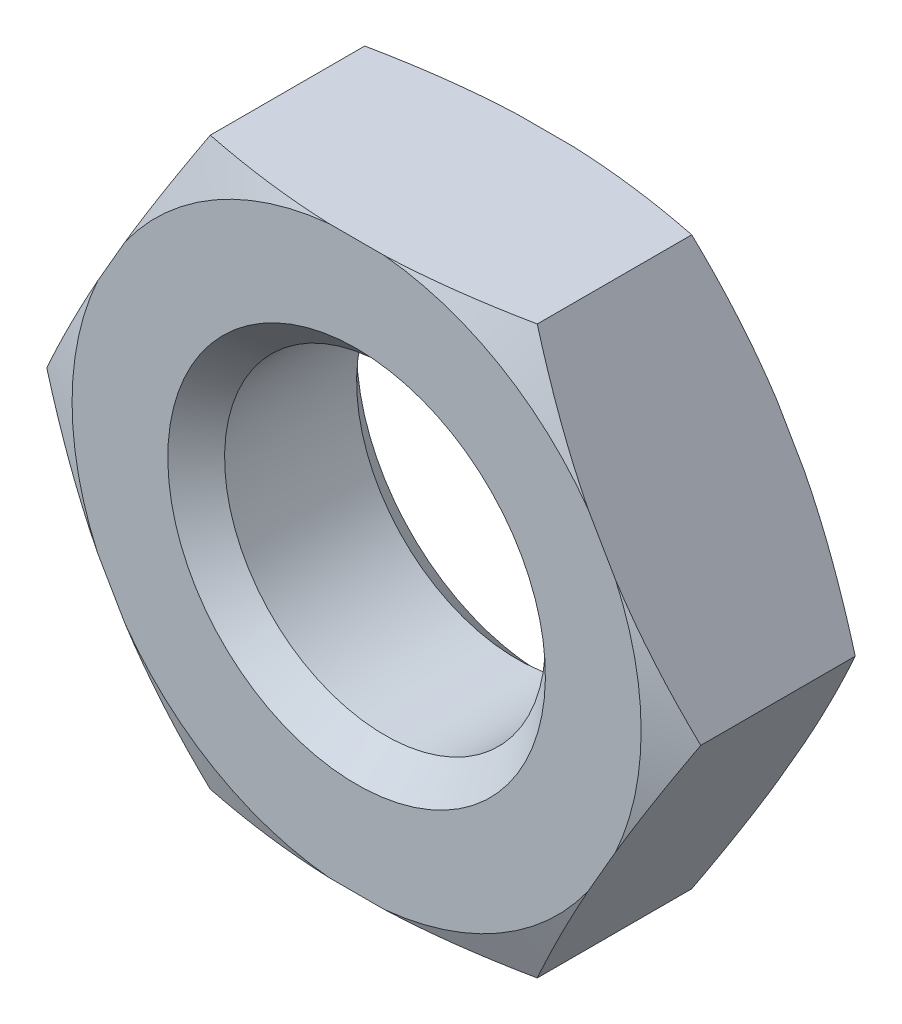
ISO-10303-21;
HEADER;
FILE_DESCRIPTION(('STEP AP214'),'2;1');
FILE_NAME('part.step','',(''),(''),'','','');
FILE_SCHEMA(('AUTOMOTIVE_DESIGN { 1 0 10303 214 1 1 1 1 }'));
ENDSEC;
DATA;
#1=APPLICATION_CONTEXT('core data for automotive mechanical design processes');
#2=APPLICATION_PROTOCOL_DEFINITION('international standard','automotive_design',2000,#1);
#3=PRODUCT_CONTEXT('',#1,'mechanical');
#4=PRODUCT('Part','Part','',(#3));
#5=PRODUCT_RELATED_PRODUCT_CATEGORY('part','',(#4));
#6=PRODUCT_DEFINITION_FORMATION('','',#4);
#7=PRODUCT_DEFINITION_CONTEXT('part definition',#1,'design');
#8=PRODUCT_DEFINITION('design','',#6,#7);
#9=PRODUCT_DEFINITION_SHAPE('','',#8);
#10=(LENGTH_UNIT() NAMED_UNIT(*) SI_UNIT(.MILLI.,.METRE.));
#11=(NAMED_UNIT(*) PLANE_ANGLE_UNIT() SI_UNIT($,.RADIAN.));
#12=(NAMED_UNIT(*) SI_UNIT($,.STERADIAN.) SOLID_ANGLE_UNIT());
#13=UNCERTAINTY_MEASURE_WITH_UNIT(LENGTH_MEASURE(1.E-05),#10,'distance_accuracy_value','');
#14=(GEOMETRIC_REPRESENTATION_CONTEXT(3) GLOBAL_UNCERTAINTY_ASSIGNED_CONTEXT((#13)) GLOBAL_UNIT_ASSIGNED_CONTEXT((#10,
#11,#12)) REPRESENTATION_CONTEXT('',''));
#15=CARTESIAN_POINT('',(0.,0.,0.));
#16=DIRECTION('',(0.,0.,1.));
#17=DIRECTION('',(1.,0.,0.));
#18=AXIS2_PLACEMENT_3D('',#15,#16,#17);
#19=CARTESIAN_POINT('',(0.,0.,0.));
#20=DIRECTION('',(0.,0.,1.));
#21=DIRECTION('',(0.,-1.,0.));
#22=AXIS2_PLACEMENT_3D('',#19,#20,#21);
#23=CONICAL_SURFACE('',#22,13.5633789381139,1.18682389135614);
#24=CARTESIAN_POINT('',(4.94006864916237,18.4435375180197,2.23438389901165));
#25=CARTESIAN_POINT('',(5.0740091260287,18.2115458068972,2.15784893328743));
#26=CARTESIAN_POINT('',(5.20809895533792,17.9792954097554,2.08236069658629));
#27=CARTESIAN_POINT('',(5.47660362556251,17.5142316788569,1.93370792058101));
#28=CARTESIAN_POINT('',(5.61101847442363,17.2814183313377,1.86054343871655));
#29=CARTESIAN_POINT('',(6.01485575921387,16.5819516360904,1.64484618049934));
#30=CARTESIAN_POINT('',(6.28479563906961,16.1144020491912,1.50615289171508));
#31=CARTESIAN_POINT('',(6.82754151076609,15.1743386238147,1.24059292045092));
#32=CARTESIAN_POINT('',(7.10035506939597,14.701811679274,1.11378776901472));
#33=CARTESIAN_POINT('',(7.64764355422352,13.7538802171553,0.875503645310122));
#34=CARTESIAN_POINT('',(7.92211835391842,13.2784759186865,0.764023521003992));
#35=CARTESIAN_POINT('',(8.46564483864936,12.3370604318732,0.562135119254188));
#36=CARTESIAN_POINT('',(8.73465227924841,11.8711258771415,0.471254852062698));
#37=CARTESIAN_POINT('',(9.27421952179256,10.9365679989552,0.310011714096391));
#38=CARTESIAN_POINT('',(9.5447793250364,10.4679446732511,0.239648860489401));
#39=CARTESIAN_POINT('',(10.086553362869,9.52956451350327,0.122464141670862));
#40=CARTESIAN_POINT('',(10.3577646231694,9.0598128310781,0.075588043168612));
#41=CARTESIAN_POINT('',(10.9009924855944,8.11891457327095,0.00737362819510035));
#42=CARTESIAN_POINT('',(11.1730090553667,7.64776805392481,-0.013965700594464));
#43=CARTESIAN_POINT('',(11.7034949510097,6.72893952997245,-0.0295933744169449));
#44=CARTESIAN_POINT('',(11.9619546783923,6.28127415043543,-0.0251934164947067));
#45=CARTESIAN_POINT('',(12.4784962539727,5.38659789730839,0.00740959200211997));
#46=CARTESIAN_POINT('',(12.7365780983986,4.93958703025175,0.0356128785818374));
#47=CARTESIAN_POINT('',(13.2524033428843,4.04615149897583,0.114603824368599));
#48=CARTESIAN_POINT('',(13.5101449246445,3.59972998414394,0.165438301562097));
#49=CARTESIAN_POINT('',(14.0243970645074,2.7090191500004,0.287585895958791));
#50=CARTESIAN_POINT('',(14.2809076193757,2.26472983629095,0.358899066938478));
#51=CARTESIAN_POINT('',(14.7988609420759,1.36760836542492,0.521468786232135));
#52=CARTESIAN_POINT('',(15.0602679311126,0.914838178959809,0.61317677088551));
#53=CARTESIAN_POINT('',(15.5815541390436,0.0119439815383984,0.8126627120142));
#54=CARTESIAN_POINT('',(15.8414332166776,-0.438179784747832,0.920442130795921));
#55=CARTESIAN_POINT('',(16.3586398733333,-1.33400799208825,1.1489987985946));
#56=CARTESIAN_POINT('',(16.6159735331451,-1.77972296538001,1.26972132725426));
#57=CARTESIAN_POINT('',(17.000897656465,-2.44643110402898,1.45911390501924));
#58=CARTESIAN_POINT('',(17.1290061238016,-2.66832147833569,1.52361870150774));
#59=CARTESIAN_POINT('',(17.3848937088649,-3.11153177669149,1.65516096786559));
#60=CARTESIAN_POINT('',(17.5126728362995,-3.33285171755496,1.72219836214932));
#61=CARTESIAN_POINT('',(17.6402989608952,-3.55390664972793,1.79038307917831));
#62=B_SPLINE_CURVE_WITH_KNOTS('',3,(#24,#25,#26,#27,#28,#29,#30,#31,#32,#33,#34,#35,#36,#37,#38,
#39,#40,#41,#42,#43,#44,#45,#46,#47,#48,#49,#50,#51,#52,#53,#54,#55,#56,#57,#58,#59,#60,#61),
.UNSPECIFIED.,.F.,.F.,(4,2,2,2,2,2,2,2,2,2,2,2,2,2,2,2,2,2,4),(0.,0.835795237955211,
1.67161111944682,3.34371288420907,5.02403972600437,6.70424018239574,8.34081235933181,
9.97738590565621,11.610162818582,13.2428750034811,14.7931324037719,16.3434051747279,
17.8969000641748,19.4503990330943,21.0424911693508,22.6347282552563,24.2204810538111,
25.0131067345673,25.8057087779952),.UNSPECIFIED.);
#63=CARTESIAN_POINT('',(12.3462073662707,5.61572897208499,0.));
#64=VERTEX_POINT('',#63);
#65=CARTESIAN_POINT('',(15.58845,0.,0.818181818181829));
#66=VERTEX_POINT('',#65);
#67=EDGE_CURVE('E294',#64,#66,#62,.T.);
#68=ORIENTED_EDGE('',*,*,#67,.T.);
#69=CARTESIAN_POINT('',(17.6402989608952,3.55390664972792,1.79038307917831));
#70=CARTESIAN_POINT('',(17.5126728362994,3.33285171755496,1.72219836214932));
#71=CARTESIAN_POINT('',(17.3848937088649,3.11153177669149,1.65516096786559));
#72=CARTESIAN_POINT('',(17.1290061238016,2.66832147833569,1.52361870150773));
#73=CARTESIAN_POINT('',(17.000897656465,2.44643110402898,1.45911390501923));
#74=CARTESIAN_POINT('',(16.6159735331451,1.77972296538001,1.26972132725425));
#75=CARTESIAN_POINT('',(16.3586398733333,1.33400799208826,1.1489987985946));
#76=CARTESIAN_POINT('',(15.8414332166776,0.438179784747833,0.920442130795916));
#77=CARTESIAN_POINT('',(15.5815541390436,-0.0119439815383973,0.812662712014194));
#78=CARTESIAN_POINT('',(15.0602679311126,-0.914838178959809,0.613176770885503));
#79=CARTESIAN_POINT('',(14.7988609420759,-1.36760836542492,0.521468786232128));
#80=CARTESIAN_POINT('',(14.2809076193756,-2.26472983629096,0.358899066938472));
#81=CARTESIAN_POINT('',(14.0243970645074,-2.7090191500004,0.287585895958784));
#82=CARTESIAN_POINT('',(13.5101449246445,-3.59972998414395,0.165438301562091));
#83=CARTESIAN_POINT('',(13.2524033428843,-4.04615149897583,0.114603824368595));
#84=CARTESIAN_POINT('',(12.7365780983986,-4.93958703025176,0.0356128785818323));
#85=CARTESIAN_POINT('',(12.4784962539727,-5.3865978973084,0.00740959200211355));
#86=CARTESIAN_POINT('',(11.9619546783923,-6.28127415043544,-0.0251934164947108));
#87=CARTESIAN_POINT('',(11.7034949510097,-6.72893952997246,-0.0295933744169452));
#88=CARTESIAN_POINT('',(11.1730090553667,-7.64776805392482,-0.0139657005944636));
#89=CARTESIAN_POINT('',(10.9009924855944,-8.11891457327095,0.00737362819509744));
#90=CARTESIAN_POINT('',(10.3577646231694,-9.05981283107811,0.0755880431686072));
#91=CARTESIAN_POINT('',(10.086553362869,-9.52956451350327,0.122464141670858));
#92=CARTESIAN_POINT('',(9.54477932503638,-10.4679446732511,0.239648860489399));
#93=CARTESIAN_POINT('',(9.27421952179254,-10.9365679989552,0.310011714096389));
#94=CARTESIAN_POINT('',(8.73465227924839,-11.8711258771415,0.471254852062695));
#95=CARTESIAN_POINT('',(8.46564483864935,-12.3370604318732,0.562135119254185));
#96=CARTESIAN_POINT('',(7.92211835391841,-13.2784759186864,0.76402352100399));
#97=CARTESIAN_POINT('',(7.6476435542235,-13.7538802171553,0.875503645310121));
#98=CARTESIAN_POINT('',(7.10035506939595,-14.701811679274,1.11378776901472));
#99=CARTESIAN_POINT('',(6.82754151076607,-15.1743386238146,1.24059292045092));
#100=CARTESIAN_POINT('',(6.2847956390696,-16.1144020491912,1.50615289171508));
#101=CARTESIAN_POINT('',(6.01485575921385,-16.5819516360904,1.64484618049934));
#102=CARTESIAN_POINT('',(5.61101847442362,-17.2814183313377,1.86054343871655));
#103=CARTESIAN_POINT('',(5.4766036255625,-17.5142316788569,1.93370792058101));
#104=CARTESIAN_POINT('',(5.20809895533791,-17.9792954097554,2.08236069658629));
#105=CARTESIAN_POINT('',(5.07400912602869,-18.2115458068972,2.15784893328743));
#106=CARTESIAN_POINT('',(4.94006864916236,-18.4435375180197,2.23438389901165));
#107=B_SPLINE_CURVE_WITH_KNOTS('',3,(#69,#70,#71,#72,#73,#74,#75,#76,#77,#78,#79,#80,#81,#82,
#83,#84,#85,#86,#87,#88,#89,#90,#91,#92,#93,#94,#95,#96,#97,#98,#99,#100,#101,#102,#103,#104,
#105,#106),.UNSPECIFIED.,.F.,.F.,(4,2,2,2,2,2,2,2,2,2,2,2,2,2,2,2,2,2,4),(0.,0.792602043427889,
1.58522772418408,3.17098052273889,4.76321760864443,6.35530974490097,7.90880871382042,
9.46230360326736,11.0125763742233,12.5628337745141,14.1955459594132,15.828322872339,
17.4648964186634,19.1014685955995,20.7816690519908,22.4619958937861,24.1340976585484,
24.96991354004,25.8057087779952),.UNSPECIFIED.);
#108=CARTESIAN_POINT('',(12.3462073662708,-5.61572897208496,0.));
#109=VERTEX_POINT('',#108);
#110=EDGE_CURVE('E33',#66,#109,#107,.T.);
#111=ORIENTED_EDGE('',*,*,#110,.T.);
#112=CARTESIAN_POINT('',(0.,0.,0.));
#113=DIRECTION('',(0.,0.,1.));
#114=DIRECTION('',(1.,0.,0.));
#115=AXIS2_PLACEMENT_3D('',#112,#113,#114);
#116=CIRCLE('',#115,13.5633789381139);
#117=EDGE_CURVE('E299',#109,#64,#116,.T.);
#118=ORIENTED_EDGE('',*,*,#117,.T.);
#119=EDGE_LOOP('',(#68,#111,#118));
#120=FACE_BOUND('',#119,.T.);
#121=ADVANCED_FACE('F16',(#120),#23,.T.);
#122=CARTESIAN_POINT('',(15.58845,0.,0.));
#123=DIRECTION('',(0.,0.,1.));
#124=DIRECTION('',(1.,0.,0.));
#125=AXIS2_PLACEMENT_3D('',#122,#123,#124);
#126=PLANE('',#125);
#127=CARTESIAN_POINT('',(0.,0.,0.));
#128=DIRECTION('',(0.,0.,-1.));
#129=DIRECTION('',(0.,1.,0.));
#130=AXIS2_PLACEMENT_3D('',#127,#128,#129);
#131=CIRCLE('',#130,13.5633789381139);
#132=CARTESIAN_POINT('',(1.30973973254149,13.4999937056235,0.));
#133=VERTEX_POINT('',#132);
#134=CARTESIAN_POINT('',(11.0364676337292,7.88426473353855,0.));
#135=VERTEX_POINT('',#134);
#136=EDGE_CURVE('E151',#133,#135,#131,.T.);
#137=ORIENTED_EDGE('',*,*,#136,.T.);
#138=DIRECTION('',(-0.5,0.866025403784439,0.));
#139=VECTOR('',#138,1.);
#140=CARTESIAN_POINT('',(15.58845,0.,0.));
#141=LINE('',#140,#139);
#142=EDGE_CURVE('E157',#64,#135,#141,.T.);
#143=ORIENTED_EDGE('',*,*,#142,.F.);
#144=ORIENTED_EDGE('',*,*,#117,.F.);
#145=DIRECTION('',(0.5,0.866025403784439,0.));
#146=VECTOR('',#145,1.);
#147=CARTESIAN_POINT('',(7.794225,-13.4999937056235,0.));
#148=LINE('',#147,#146);
#149=CARTESIAN_POINT('',(11.0364676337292,-7.88426473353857,0.));
#150=VERTEX_POINT('',#149);
#151=EDGE_CURVE('E340',#150,#109,#148,.T.);
#152=ORIENTED_EDGE('',*,*,#151,.F.);
#153=CARTESIAN_POINT('',(1.30973973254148,-13.4999937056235,0.));
#154=VERTEX_POINT('',#153);
#155=EDGE_CURVE('E306',#154,#150,#116,.T.);
#156=ORIENTED_EDGE('',*,*,#155,.F.);
#157=DIRECTION('',(1.,0.,0.));
#158=VECTOR('',#157,1.);
#159=CARTESIAN_POINT('',(-7.794225,-13.4999937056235,0.));
#160=LINE('',#159,#158);
#161=CARTESIAN_POINT('',(-1.30973973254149,-13.4999937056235,0.));
#162=VERTEX_POINT('',#161);
#163=EDGE_CURVE('E326',#162,#154,#160,.T.);
#164=ORIENTED_EDGE('',*,*,#163,.F.);
#165=CARTESIAN_POINT('',(-11.0364676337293,-7.88426473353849,0.));
#166=VERTEX_POINT('',#165);
#167=EDGE_CURVE('E379',#166,#162,#116,.T.);
#168=ORIENTED_EDGE('',*,*,#167,.F.);
#169=DIRECTION('',(0.5,-0.866025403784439,0.));
#170=VECTOR('',#169,1.);
#171=CARTESIAN_POINT('',(-15.58845,0.,0.));
#172=LINE('',#171,#170);
#173=CARTESIAN_POINT('',(-12.3462073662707,-5.61572897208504,0.));
#174=VERTEX_POINT('',#173);
#175=EDGE_CURVE('E345',#174,#166,#172,.T.);
#176=ORIENTED_EDGE('',*,*,#175,.F.);
#177=CARTESIAN_POINT('',(-12.3462073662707,5.61572897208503,0.));
#178=VERTEX_POINT('',#177);
#179=EDGE_CURVE('E357',#178,#174,#116,.T.);
#180=ORIENTED_EDGE('',*,*,#179,.F.);
#181=DIRECTION('',(-0.5,-0.866025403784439,0.));
#182=VECTOR('',#181,1.);
#183=CARTESIAN_POINT('',(-7.794225,13.4999937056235,0.));
#184=LINE('',#183,#182);
#185=CARTESIAN_POINT('',(-11.0364676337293,7.88426473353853,0.));
#186=VERTEX_POINT('',#185);
#187=EDGE_CURVE('E156',#186,#178,#184,.T.);
#188=ORIENTED_EDGE('',*,*,#187,.F.);
#189=CARTESIAN_POINT('',(-1.30973973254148,13.4999937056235,0.));
#190=VERTEX_POINT('',#189);
#191=EDGE_CURVE('E153',#190,#186,#116,.T.);
#192=ORIENTED_EDGE('',*,*,#191,.F.);
#193=DIRECTION('',(-1.,0.,0.));
#194=VECTOR('',#193,1.);
#195=CARTESIAN_POINT('',(7.794225,13.4999937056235,0.));
#196=LINE('',#195,#194);
#197=EDGE_CURVE('E146',#133,#190,#196,.T.);
#198=ORIENTED_EDGE('',*,*,#197,.F.);
#199=EDGE_LOOP('',(#137,#143,#144,#152,#156,#164,#168,#176,#180,#188,#192,#198));
#200=FACE_BOUND('',#199,.T.);
#201=CARTESIAN_POINT('',(0.,0.,0.));
#202=DIRECTION('',(0.,0.,-1.));
#203=DIRECTION('',(0.,1.,0.));
#204=AXIS2_PLACEMENT_3D('',#201,#202,#203);
#205=CIRCLE('',#204,9.);
#206=CARTESIAN_POINT('',(0.,9.,0.));
#207=VERTEX_POINT('',#206);
#208=EDGE_CURVE('E169',#207,#207,#205,.T.);
#209=ORIENTED_EDGE('',*,*,#208,.F.);
#210=EDGE_LOOP('',(#209));
#211=FACE_BOUND('',#210,.T.);
#212=ADVANCED_FACE('F148',(#200,#211),#126,.F.);
#213=CARTESIAN_POINT('',(7.794225,-13.4999937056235,9.00000000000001));
#214=DIRECTION('',(-0.866025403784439,0.5,0.));
#215=DIRECTION('',(-0.5,-0.866025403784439,0.));
#216=AXIS2_PLACEMENT_3D('',#213,#214,#215);
#217=PLANE('',#216);
#218=CARTESIAN_POINT('',(4.94006864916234,-18.4435375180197,6.76561610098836));
#219=CARTESIAN_POINT('',(5.07400912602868,-18.2115458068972,6.84215106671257));
#220=CARTESIAN_POINT('',(5.2080989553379,-17.9792954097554,6.91763930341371));
#221=CARTESIAN_POINT('',(5.4766036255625,-17.5142316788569,7.06629207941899));
#222=CARTESIAN_POINT('',(5.61101847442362,-17.2814183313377,7.13945656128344));
#223=CARTESIAN_POINT('',(6.01485575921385,-16.5819516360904,7.35515381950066));
#224=CARTESIAN_POINT('',(6.28479563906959,-16.1144020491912,7.49384710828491));
#225=CARTESIAN_POINT('',(6.82754151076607,-15.1743386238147,7.75940707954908));
#226=CARTESIAN_POINT('',(7.10035506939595,-14.701811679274,7.88621223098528));
#227=CARTESIAN_POINT('',(7.6476435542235,-13.7538802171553,8.12449635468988));
#228=CARTESIAN_POINT('',(7.92211835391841,-13.2784759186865,8.23597647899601));
#229=CARTESIAN_POINT('',(8.46564483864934,-12.3370604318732,8.43786488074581));
#230=CARTESIAN_POINT('',(8.73465227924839,-11.8711258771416,8.5287451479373));
#231=CARTESIAN_POINT('',(9.27421952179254,-10.9365679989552,8.68998828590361));
#232=CARTESIAN_POINT('',(9.54477932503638,-10.4679446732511,8.7603511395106));
#233=CARTESIAN_POINT('',(10.086553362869,-9.52956451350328,8.87753585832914));
#234=CARTESIAN_POINT('',(10.3577646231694,-9.05981283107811,8.92441195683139));
#235=CARTESIAN_POINT('',(10.9009924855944,-8.11891457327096,8.9926263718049));
#236=CARTESIAN_POINT('',(11.1730090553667,-7.64776805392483,9.01396570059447));
#237=CARTESIAN_POINT('',(11.7034949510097,-6.72893952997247,9.02959337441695));
#238=CARTESIAN_POINT('',(11.9619546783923,-6.28127415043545,9.02519341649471));
#239=CARTESIAN_POINT('',(12.4784962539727,-5.3865978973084,8.99259040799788));
#240=CARTESIAN_POINT('',(12.7365780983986,-4.93958703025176,8.96438712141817));
#241=CARTESIAN_POINT('',(13.2524033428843,-4.04615149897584,8.88539617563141));
#242=CARTESIAN_POINT('',(13.5101449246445,-3.59972998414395,8.83456169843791));
#243=CARTESIAN_POINT('',(14.0243970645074,-2.70901915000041,8.71241410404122));
#244=CARTESIAN_POINT('',(14.2809076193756,-2.26472983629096,8.64110093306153));
#245=CARTESIAN_POINT('',(14.7988609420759,-1.36760836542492,8.47853121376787));
#246=CARTESIAN_POINT('',(15.0602679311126,-0.914838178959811,8.38682322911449));
#247=CARTESIAN_POINT('',(15.5815541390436,-0.0119439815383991,8.18733728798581));
#248=CARTESIAN_POINT('',(15.8414332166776,0.43817978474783,8.07955786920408));
#249=CARTESIAN_POINT('',(16.3586398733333,1.33400799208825,7.8510012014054));
#250=CARTESIAN_POINT('',(16.6159735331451,1.77972296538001,7.73027867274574));
#251=CARTESIAN_POINT('',(17.000897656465,2.44643110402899,7.54088609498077));
#252=CARTESIAN_POINT('',(17.1290061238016,2.66832147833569,7.47638129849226));
#253=CARTESIAN_POINT('',(17.3848937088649,3.11153177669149,7.34483903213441));
#254=CARTESIAN_POINT('',(17.5126728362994,3.33285171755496,7.27780163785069));
#255=CARTESIAN_POINT('',(17.6402989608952,3.55390664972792,7.2096169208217));
#256=B_SPLINE_CURVE_WITH_KNOTS('',3,(#218,#219,#220,#221,#222,#223,#224,#225,#226,#227,#228,
#229,#230,#231,#232,#233,#234,#235,#236,#237,#238,#239,#240,#241,#242,#243,#244,#245,#246,#247,
#248,#249,#250,#251,#252,#253,#254,#255),.UNSPECIFIED.,.F.,.F.,(4,2,2,2,2,2,2,2,2,2,2,2,2,2,2,2,
2,2,4),(0.,0.835795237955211,1.67161111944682,3.34371288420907,5.02403972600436,
6.70424018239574,8.3408123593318,9.9773859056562,11.610162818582,13.2428750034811,
14.7931324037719,16.3434051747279,17.8969000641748,19.4503990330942,21.0424911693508,
22.6347282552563,24.2204810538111,25.0131067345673,25.8057087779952),.UNSPECIFIED.);
#257=CARTESIAN_POINT('',(7.794225,-13.4999937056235,8.18181818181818));
#258=VERTEX_POINT('',#257);
#259=CARTESIAN_POINT('',(11.0364676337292,-7.88426473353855,9.00000000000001));
#260=VERTEX_POINT('',#259);
#261=EDGE_CURVE('E219',#258,#260,#256,.T.);
#262=ORIENTED_EDGE('',*,*,#261,.F.);
#263=DIRECTION('',(0.,0.,-1.));
#264=VECTOR('',#263,1.);
#265=CARTESIAN_POINT('',(7.794225,-13.4999937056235,9.00000000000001));
#266=LINE('',#265,#264);
#267=CARTESIAN_POINT('',(7.794225,-13.4999937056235,0.818181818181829));
#268=VERTEX_POINT('',#267);
#269=EDGE_CURVE('E318',#258,#268,#266,.T.);
#270=ORIENTED_EDGE('',*,*,#269,.T.);
#271=EDGE_CURVE('E284',#150,#268,#107,.T.);
#272=ORIENTED_EDGE('',*,*,#271,.F.);
#273=ORIENTED_EDGE('',*,*,#151,.T.);
#274=ORIENTED_EDGE('',*,*,#110,.F.);
#275=DIRECTION('',(0.,0.,-1.));
#276=VECTOR('',#275,1.);
#277=CARTESIAN_POINT('',(15.58845,0.,9.00000000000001));
#278=LINE('',#277,#276);
#279=CARTESIAN_POINT('',(15.58845,0.,8.18181818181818));
#280=VERTEX_POINT('',#279);
#281=EDGE_CURVE('E301',#280,#66,#278,.T.);
#282=ORIENTED_EDGE('',*,*,#281,.F.);
#283=CARTESIAN_POINT('',(12.3462073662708,-5.61572897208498,9.00000000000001));
#284=VERTEX_POINT('',#283);
#285=EDGE_CURVE('E342',#284,#280,#256,.T.);
#286=ORIENTED_EDGE('',*,*,#285,.F.);
#287=DIRECTION('',(0.5,0.866025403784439,0.));
#288=VECTOR('',#287,1.);
#289=CARTESIAN_POINT('',(7.794225,-13.4999937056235,9.00000000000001));
#290=LINE('',#289,#288);
#291=EDGE_CURVE('E322',#260,#284,#290,.T.);
#292=ORIENTED_EDGE('',*,*,#291,.F.);
#293=EDGE_LOOP('',(#262,#270,#272,#273,#274,#282,#286,#292));
#294=FACE_BOUND('',#293,.T.);
#295=ADVANCED_FACE('F18',(#294),#217,.F.);
#296=CARTESIAN_POINT('',(15.58845,0.,9.00000000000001));
#297=DIRECTION('',(-0.866025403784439,-0.5,0.));
#298=DIRECTION('',(0.5,-0.866025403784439,0.));
#299=AXIS2_PLACEMENT_3D('',#296,#297,#298);
#300=PLANE('',#299);
#301=CARTESIAN_POINT('',(17.6402989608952,-3.55390664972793,7.2096169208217));
#302=CARTESIAN_POINT('',(17.5126728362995,-3.33285171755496,7.27780163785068));
#303=CARTESIAN_POINT('',(17.3848937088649,-3.11153177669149,7.34483903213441));
#304=CARTESIAN_POINT('',(17.1290061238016,-2.66832147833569,7.47638129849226));
#305=CARTESIAN_POINT('',(17.000897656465,-2.44643110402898,7.54088609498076));
#306=CARTESIAN_POINT('',(16.6159735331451,-1.77972296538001,7.73027867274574));
#307=CARTESIAN_POINT('',(16.3586398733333,-1.33400799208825,7.8510012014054));
#308=CARTESIAN_POINT('',(15.8414332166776,-0.438179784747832,8.07955786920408));
#309=CARTESIAN_POINT('',(15.5815541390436,0.0119439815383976,8.1873372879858));
#310=CARTESIAN_POINT('',(15.0602679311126,0.914838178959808,8.38682322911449));
#311=CARTESIAN_POINT('',(14.7988609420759,1.36760836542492,8.47853121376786));
#312=CARTESIAN_POINT('',(14.2809076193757,2.26472983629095,8.64110093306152));
#313=CARTESIAN_POINT('',(14.0243970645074,2.7090191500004,8.71241410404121));
#314=CARTESIAN_POINT('',(13.5101449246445,3.59972998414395,8.8345616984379));
#315=CARTESIAN_POINT('',(13.2524033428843,4.04615149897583,8.8853961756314));
#316=CARTESIAN_POINT('',(12.7365780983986,4.93958703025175,8.96438712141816));
#317=CARTESIAN_POINT('',(12.4784962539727,5.38659789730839,8.99259040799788));
#318=CARTESIAN_POINT('',(11.9619546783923,6.28127415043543,9.0251934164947));
#319=CARTESIAN_POINT('',(11.7034949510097,6.72893952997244,9.02959337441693));
#320=CARTESIAN_POINT('',(11.1730090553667,7.64776805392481,9.01396570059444));
#321=CARTESIAN_POINT('',(10.9009924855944,8.11891457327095,8.99262637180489));
#322=CARTESIAN_POINT('',(10.3577646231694,9.05981283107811,8.92441195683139));
#323=CARTESIAN_POINT('',(10.086553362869,9.52956451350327,8.87753585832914));
#324=CARTESIAN_POINT('',(9.54477932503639,10.4679446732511,8.76035113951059));
#325=CARTESIAN_POINT('',(9.27421952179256,10.9365679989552,8.6899882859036));
#326=CARTESIAN_POINT('',(8.73465227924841,11.8711258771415,8.5287451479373));
#327=CARTESIAN_POINT('',(8.46564483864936,12.3370604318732,8.43786488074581));
#328=CARTESIAN_POINT('',(7.92211835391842,13.2784759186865,8.235976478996));
#329=CARTESIAN_POINT('',(7.64764355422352,13.7538802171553,8.12449635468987));
#330=CARTESIAN_POINT('',(7.10035506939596,14.701811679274,7.88621223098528));
#331=CARTESIAN_POINT('',(6.82754151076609,15.1743386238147,7.75940707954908));
#332=CARTESIAN_POINT('',(6.28479563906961,16.1144020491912,7.49384710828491));
#333=CARTESIAN_POINT('',(6.01485575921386,16.5819516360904,7.35515381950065));
#334=CARTESIAN_POINT('',(5.61101847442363,17.2814183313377,7.13945656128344));
#335=CARTESIAN_POINT('',(5.47660362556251,17.5142316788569,7.06629207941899));
#336=CARTESIAN_POINT('',(5.20809895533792,17.9792954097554,6.9176393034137));
#337=CARTESIAN_POINT('',(5.0740091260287,18.2115458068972,6.84215106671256));
#338=CARTESIAN_POINT('',(4.94006864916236,18.4435375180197,6.76561610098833));
#339=B_SPLINE_CURVE_WITH_KNOTS('',3,(#301,#302,#303,#304,#305,#306,#307,#308,#309,#310,#311,
#312,#313,#314,#315,#316,#317,#318,#319,#320,#321,#322,#323,#324,#325,#326,#327,#328,#329,#330,
#331,#332,#333,#334,#335,#336,#337,#338),.UNSPECIFIED.,.F.,.F.,(4,2,2,2,2,2,2,2,2,2,2,2,2,2,2,2,
2,2,4),(0.,0.792602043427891,1.58522772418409,3.17098052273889,4.76321760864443,
6.35530974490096,7.90880871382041,9.46230360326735,11.0125763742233,12.5628337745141,
14.1955459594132,15.828322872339,17.4648964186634,19.1014685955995,20.7816690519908,
22.4619958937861,24.1340976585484,24.96991354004,25.8057087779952),.UNSPECIFIED.);
#340=CARTESIAN_POINT('',(12.3462073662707,5.615728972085,9.00000000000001));
#341=VERTEX_POINT('',#340);
#342=EDGE_CURVE('E303',#280,#341,#339,.T.);
#343=ORIENTED_EDGE('',*,*,#342,.F.);
#344=ORIENTED_EDGE('',*,*,#281,.T.);
#345=ORIENTED_EDGE('',*,*,#67,.F.);
#346=ORIENTED_EDGE('',*,*,#142,.T.);
#347=CARTESIAN_POINT('',(7.794225,13.4999937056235,0.818181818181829));
#348=VERTEX_POINT('',#347);
#349=EDGE_CURVE('E41',#348,#135,#62,.T.);
#350=ORIENTED_EDGE('',*,*,#349,.F.);
#351=DIRECTION('',(0.,0.,-1.));
#352=VECTOR('',#351,1.);
#353=CARTESIAN_POINT('',(7.794225,13.4999937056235,9.00000000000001));
#354=LINE('',#353,#352);
#355=CARTESIAN_POINT('',(7.794225,13.4999937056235,8.18181818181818));
#356=VERTEX_POINT('',#355);
#357=EDGE_CURVE('E163',#356,#348,#354,.T.);
#358=ORIENTED_EDGE('',*,*,#357,.F.);
#359=CARTESIAN_POINT('',(11.0364676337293,7.88426473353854,9.00000000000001));
#360=VERTEX_POINT('',#359);
#361=EDGE_CURVE('E261',#360,#356,#339,.T.);
#362=ORIENTED_EDGE('',*,*,#361,.F.);
#363=DIRECTION('',(-0.5,0.866025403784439,0.));
#364=VECTOR('',#363,1.);
#365=CARTESIAN_POINT('',(15.58845,0.,9.00000000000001));
#366=LINE('',#365,#364);
#367=EDGE_CURVE('E325',#341,#360,#366,.T.);
#368=ORIENTED_EDGE('',*,*,#367,.F.);
#369=EDGE_LOOP('',(#343,#344,#345,#346,#350,#358,#362,#368));
#370=FACE_BOUND('',#369,.T.);
#371=ADVANCED_FACE('F269',(#370),#300,.F.);
#372=CARTESIAN_POINT('',(7.794225,13.4999937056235,9.00000000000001));
#373=DIRECTION('',(0.,-1.,0.));
#374=DIRECTION('',(1.,0.,0.));
#375=AXIS2_PLACEMENT_3D('',#372,#373,#374);
#376=PLANE('',#375);
#377=CARTESIAN_POINT('',(-20.6502000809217,13.4999937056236,4.51204675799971));
#378=CARTESIAN_POINT('',(-20.3455041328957,13.4999937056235,4.61508459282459));
#379=CARTESIAN_POINT('',(-20.0406024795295,13.4999937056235,4.71751380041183));
#380=CARTESIAN_POINT('',(-19.4303452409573,13.4999937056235,4.92101768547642));
#381=CARTESIAN_POINT('',(-19.1249896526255,13.4999937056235,5.02209235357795));
#382=CARTESIAN_POINT('',(-18.2081288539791,13.4999937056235,5.32309478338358));
#383=CARTESIAN_POINT('',(-17.5958851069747,13.4999937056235,5.52078214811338));
#384=CARTESIAN_POINT('',(-16.3675938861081,13.4999937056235,5.9092557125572));
#385=CARTESIAN_POINT('',(-15.7515408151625,13.4999937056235,6.10002425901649));
#386=CARTESIAN_POINT('',(-14.5166610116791,13.4999937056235,6.47234578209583));
#387=CARTESIAN_POINT('',(-13.8978343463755,13.4999937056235,6.65389898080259));
#388=CARTESIAN_POINT('',(-12.6648058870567,13.4999937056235,7.00322252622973));
#389=CARTESIAN_POINT('',(-12.0506457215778,13.4999937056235,7.17113908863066));
#390=CARTESIAN_POINT('',(-10.8185963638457,13.4999937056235,7.49286642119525));
#391=CARTESIAN_POINT('',(-10.2007070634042,13.4999937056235,7.64667677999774));
#392=CARTESIAN_POINT('',(-8.96110063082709,13.4999937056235,7.93653384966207));
#393=CARTESIAN_POINT('',(-8.33938579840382,13.4999937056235,8.07259031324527));
#394=CARTESIAN_POINT('',(-7.09153460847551,13.4999937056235,8.3227481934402));
#395=CARTESIAN_POINT('',(-6.46539856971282,13.4999937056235,8.43685117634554));
#396=CARTESIAN_POINT('',(-5.33723543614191,13.4999937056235,8.61774316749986));
#397=CARTESIAN_POINT('',(-4.83599866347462,13.4999937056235,8.68943599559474));
#398=CARTESIAN_POINT('',(-3.83112337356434,13.4999937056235,8.81352193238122));
#399=CARTESIAN_POINT('',(-3.32748491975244,13.4999937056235,8.86591554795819));
#400=CARTESIAN_POINT('',(-2.3187502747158,13.4999937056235,8.94933026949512));
#401=CARTESIAN_POINT('',(-1.81365525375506,13.4999937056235,8.98036534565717));
#402=CARTESIAN_POINT('',(-0.802572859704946,13.4999937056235,9.01976142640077));
#403=CARTESIAN_POINT('',(-0.296585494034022,13.4999937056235,9.02812261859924));
#404=CARTESIAN_POINT('',(0.717667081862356,13.4999937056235,9.02176947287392));
#405=CARTESIAN_POINT('',(1.22593159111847,13.4999937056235,9.00694438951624));
#406=CARTESIAN_POINT('',(2.24128883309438,13.4999937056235,8.95469660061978));
#407=CARTESIAN_POINT('',(2.74838154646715,13.4999937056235,8.91727352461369));
#408=CARTESIAN_POINT('',(3.76087773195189,13.4999937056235,8.82140770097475));
#409=CARTESIAN_POINT('',(4.26627991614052,13.4999937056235,8.76295152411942));
#410=CARTESIAN_POINT('',(5.27452049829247,13.4999937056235,8.62723488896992));
#411=CARTESIAN_POINT('',(5.77735890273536,13.4999937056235,8.5499744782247));
#412=CARTESIAN_POINT('',(6.86292396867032,13.4999937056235,8.36501522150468));
#413=CARTESIAN_POINT('',(7.44515008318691,13.4999937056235,8.25439788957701));
#414=CARTESIAN_POINT('',(8.6058344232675,13.4999937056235,8.01476846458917));
#415=CARTESIAN_POINT('',(9.18429217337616,13.4999937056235,7.88575409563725));
#416=CARTESIAN_POINT('',(10.3379172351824,13.4999937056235,7.61265888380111));
#417=CARTESIAN_POINT('',(10.9130827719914,13.4999937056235,7.46857059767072));
#418=CARTESIAN_POINT('',(12.060187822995,13.4999937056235,7.16823390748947));
#419=CARTESIAN_POINT('',(12.6321274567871,13.4999937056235,7.01198595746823));
#420=CARTESIAN_POINT('',(13.7747188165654,13.4999937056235,6.68921325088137));
#421=CARTESIAN_POINT('',(14.3453631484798,13.4999937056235,6.52266243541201));
#422=CARTESIAN_POINT('',(15.4842385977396,13.4999937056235,6.1815188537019));
#423=CARTESIAN_POINT('',(16.0524696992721,13.4999937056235,6.00692603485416));
#424=CARTESIAN_POINT('',(17.1867135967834,13.4999937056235,5.65122342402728));
#425=CARTESIAN_POINT('',(17.7527269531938,13.4999937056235,5.47011541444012));
#426=CARTESIAN_POINT('',(18.8829934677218,13.4999937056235,5.10250504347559));
#427=CARTESIAN_POINT('',(19.4472466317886,13.4999937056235,4.91600270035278));
#428=CARTESIAN_POINT('',(20.5706417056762,13.4999937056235,4.5397408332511));
#429=CARTESIAN_POINT('',(21.1297931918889,13.4999937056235,4.35000985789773));
#430=CARTESIAN_POINT('',(22.2468310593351,13.4999937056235,3.96685665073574));
#431=CARTESIAN_POINT('',(22.8047174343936,13.4999937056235,3.77343440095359));
#432=CARTESIAN_POINT('',(24.4768336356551,13.4999937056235,3.18851060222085));
#433=CARTESIAN_POINT('',(25.5894441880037,13.4999937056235,2.79237776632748));
#434=CARTESIAN_POINT('',(27.2522393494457,13.4999937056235,2.1928251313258));
#435=CARTESIAN_POINT('',(27.8036418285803,13.4999937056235,1.99276306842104));
#436=CARTESIAN_POINT('',(28.9057505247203,13.4999937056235,1.59072671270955));
#437=CARTESIAN_POINT('',(29.4564567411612,13.4999937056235,1.38875241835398));
#438=CARTESIAN_POINT('',(30.5571908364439,13.4999937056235,0.983182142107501));
#439=CARTESIAN_POINT('',(31.1072187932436,13.4999937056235,0.779586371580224));
#440=CARTESIAN_POINT('',(32.2067368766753,13.4999937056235,0.370953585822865));
#441=CARTESIAN_POINT('',(32.7562270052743,13.4999937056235,0.165916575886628));
#442=CARTESIAN_POINT('',(33.3054851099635,13.4999937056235,-0.0397387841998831));
#443=B_SPLINE_CURVE_WITH_KNOTS('',3,(#377,#378,#379,#380,#381,#382,#383,#384,#385,#386,#387,
#388,#389,#390,#391,#392,#393,#394,#395,#396,#397,#398,#399,#400,#401,#402,#403,#404,#405,#406,
#407,#408,#409,#410,#411,#412,#413,#414,#415,#416,#417,#418,#419,#420,#421,#422,#423,#424,#425,
#426,#427,#428,#429,#430,#431,#432,#433,#434,#435,#436,#437,#438,#439,#440,#441,#442),
.UNSPECIFIED.,.F.,.F.,(4,2,2,2,2,2,2,2,2,2,2,2,2,2,2,2,2,2,2,2,2,2,2,2,2,2,2,2,2,2,2,2,4),(0.,
0.964938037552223,1.92988275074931,3.85994797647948,5.79463350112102,7.7292723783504,
9.63924502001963,11.5492733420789,13.4582479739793,15.3670863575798,16.8857780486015,
18.4044298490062,19.9220873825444,21.4397323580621,22.9646482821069,24.4895892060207,
26.0155055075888,27.5414179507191,29.3189699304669,31.0967420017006,32.8753960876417,
34.6539837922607,36.4372701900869,38.2205682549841,40.0033821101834,41.7861899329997,
43.5575677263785,45.328954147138,48.8719687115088,50.631690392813,52.3914134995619,
54.1509108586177,55.9104017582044),.UNSPECIFIED.);
#444=CARTESIAN_POINT('',(1.30973973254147,13.4999937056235,9.00000000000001));
#445=VERTEX_POINT('',#444);
#446=EDGE_CURVE('E259',#356,#445,#443,.F.);
#447=ORIENTED_EDGE('',*,*,#446,.F.);
#448=ORIENTED_EDGE('',*,*,#357,.T.);
#449=CARTESIAN_POINT('',(-20.6502000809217,13.4999937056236,4.4879532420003));
#450=CARTESIAN_POINT('',(-20.3455041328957,13.4999937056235,4.38491540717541));
#451=CARTESIAN_POINT('',(-20.0406024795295,13.4999937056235,4.28248619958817));
#452=CARTESIAN_POINT('',(-19.4303452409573,13.4999937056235,4.07898231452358));
#453=CARTESIAN_POINT('',(-19.1249896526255,13.4999937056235,3.97790764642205));
#454=CARTESIAN_POINT('',(-18.2081288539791,13.4999937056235,3.67690521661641));
#455=CARTESIAN_POINT('',(-17.5958851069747,13.4999937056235,3.47921785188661));
#456=CARTESIAN_POINT('',(-16.3675938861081,13.4999937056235,3.09074428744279));
#457=CARTESIAN_POINT('',(-15.7515408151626,13.4999937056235,2.89997574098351));
#458=CARTESIAN_POINT('',(-14.5166610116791,13.4999937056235,2.52765421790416));
#459=CARTESIAN_POINT('',(-13.8978343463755,13.4999937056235,2.34610101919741));
#460=CARTESIAN_POINT('',(-12.6648058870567,13.4999937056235,1.99677747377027));
#461=CARTESIAN_POINT('',(-12.0506457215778,13.4999937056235,1.82886091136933));
#462=CARTESIAN_POINT('',(-10.8185963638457,13.4999937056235,1.50713357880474));
#463=CARTESIAN_POINT('',(-10.2007070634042,13.4999937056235,1.35332322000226));
#464=CARTESIAN_POINT('',(-8.96110063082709,13.4999937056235,1.06346615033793));
#465=CARTESIAN_POINT('',(-8.33938579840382,13.4999937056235,0.927409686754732));
#466=CARTESIAN_POINT('',(-7.0915346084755,13.4999937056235,0.677251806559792));
#467=CARTESIAN_POINT('',(-6.46539856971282,13.4999937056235,0.563148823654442));
#468=CARTESIAN_POINT('',(-5.3372354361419,13.4999937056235,0.382256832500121));
#469=CARTESIAN_POINT('',(-4.83599866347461,13.4999937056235,0.310564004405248));
#470=CARTESIAN_POINT('',(-3.83112337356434,13.4999937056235,0.186478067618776));
#471=CARTESIAN_POINT('',(-3.32748491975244,13.4999937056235,0.134084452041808));
#472=CARTESIAN_POINT('',(-2.3187502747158,13.4999937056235,0.0506697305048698));
#473=CARTESIAN_POINT('',(-1.81365525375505,13.4999937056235,0.0196346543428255));
#474=CARTESIAN_POINT('',(-0.802572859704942,13.4999937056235,-0.0197614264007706));
#475=CARTESIAN_POINT('',(-0.296585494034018,13.4999937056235,-0.0281226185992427));
#476=CARTESIAN_POINT('',(0.717667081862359,13.4999937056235,-0.0217694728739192));
#477=CARTESIAN_POINT('',(1.22593159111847,13.4999937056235,-0.00694438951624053));
#478=CARTESIAN_POINT('',(2.24128883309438,13.4999937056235,0.0453033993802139));
#479=CARTESIAN_POINT('',(2.74838154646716,13.4999937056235,0.0827264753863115));
#480=CARTESIAN_POINT('',(3.7608777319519,13.4999937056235,0.178592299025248));
#481=CARTESIAN_POINT('',(4.26627991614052,13.4999937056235,0.237048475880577));
#482=CARTESIAN_POINT('',(5.27452049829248,13.4999937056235,0.372765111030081));
#483=CARTESIAN_POINT('',(5.77735890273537,13.4999937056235,0.450025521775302));
#484=CARTESIAN_POINT('',(6.86292396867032,13.4999937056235,0.634984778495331));
#485=CARTESIAN_POINT('',(7.44515008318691,13.4999937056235,0.74560211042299));
#486=CARTESIAN_POINT('',(8.60583442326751,13.4999937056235,0.985231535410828));
#487=CARTESIAN_POINT('',(9.18429217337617,13.4999937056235,1.11424590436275));
#488=CARTESIAN_POINT('',(10.3379172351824,13.4999937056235,1.38734111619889));
#489=CARTESIAN_POINT('',(10.9130827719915,13.4999937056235,1.53142940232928));
#490=CARTESIAN_POINT('',(12.060187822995,13.4999937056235,1.83176609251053));
#491=CARTESIAN_POINT('',(12.6321274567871,13.4999937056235,1.98801404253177));
#492=CARTESIAN_POINT('',(13.7747188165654,13.4999937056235,2.31078674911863));
#493=CARTESIAN_POINT('',(14.3453631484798,13.4999937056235,2.47733756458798));
#494=CARTESIAN_POINT('',(15.4842385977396,13.4999937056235,2.8184811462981));
#495=CARTESIAN_POINT('',(16.0524696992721,13.4999937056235,2.99307396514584));
#496=CARTESIAN_POINT('',(17.1867135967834,13.4999937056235,3.34877657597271));
#497=CARTESIAN_POINT('',(17.7527269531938,13.4999937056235,3.52988458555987));
#498=CARTESIAN_POINT('',(18.8829934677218,13.4999937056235,3.8974949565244));
#499=CARTESIAN_POINT('',(19.4472466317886,13.4999937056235,4.08399729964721));
#500=CARTESIAN_POINT('',(20.5706417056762,13.4999937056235,4.46025916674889));
#501=CARTESIAN_POINT('',(21.1297931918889,13.4999937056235,4.64999014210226));
#502=CARTESIAN_POINT('',(22.2468310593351,13.4999937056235,5.03314334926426));
#503=CARTESIAN_POINT('',(22.8047174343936,13.4999937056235,5.22656559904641));
#504=CARTESIAN_POINT('',(24.4768336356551,13.4999937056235,5.81148939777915));
#505=CARTESIAN_POINT('',(25.5894441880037,13.4999937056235,6.20762223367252));
#506=CARTESIAN_POINT('',(27.2522393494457,13.4999937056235,6.8071748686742));
#507=CARTESIAN_POINT('',(27.8036418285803,13.4999937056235,7.00723693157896));
#508=CARTESIAN_POINT('',(28.9057505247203,13.4999937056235,7.40927328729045));
#509=CARTESIAN_POINT('',(29.4564567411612,13.4999937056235,7.61124758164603));
#510=CARTESIAN_POINT('',(30.5571908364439,13.4999937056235,8.0168178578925));
#511=CARTESIAN_POINT('',(31.1072187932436,13.4999937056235,8.22041362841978));
#512=CARTESIAN_POINT('',(32.2067368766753,13.4999937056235,8.62904641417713));
#513=CARTESIAN_POINT('',(32.7562270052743,13.4999937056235,8.83408342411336));
#514=CARTESIAN_POINT('',(33.3054851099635,13.4999937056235,9.03973878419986));
#515=B_SPLINE_CURVE_WITH_KNOTS('',3,(#449,#450,#451,#452,#453,#454,#455,#456,#457,#458,#459,
#460,#461,#462,#463,#464,#465,#466,#467,#468,#469,#470,#471,#472,#473,#474,#475,#476,#477,#478,
#479,#480,#481,#482,#483,#484,#485,#486,#487,#488,#489,#490,#491,#492,#493,#494,#495,#496,#497,
#498,#499,#500,#501,#502,#503,#504,#505,#506,#507,#508,#509,#510,#511,#512,#513,#514),
.UNSPECIFIED.,.F.,.F.,(4,2,2,2,2,2,2,2,2,2,2,2,2,2,2,2,2,2,2,2,2,2,2,2,2,2,2,2,2,2,2,2,4),(0.,
0.964938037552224,1.92988275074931,3.85994797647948,5.79463350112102,7.72927237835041,
9.63924502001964,11.549273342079,13.4582479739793,15.3670863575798,16.8857780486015,
18.4044298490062,19.9220873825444,21.4397323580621,22.9646482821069,24.4895892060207,
26.0155055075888,27.5414179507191,29.3189699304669,31.0967420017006,32.8753960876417,
34.6539837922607,36.4372701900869,38.2205682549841,40.0033821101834,41.7861899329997,
43.5575677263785,45.328954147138,48.8719687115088,50.631690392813,52.3914134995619,
54.1509108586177,55.9104017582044),.UNSPECIFIED.);
#516=EDGE_CURVE('E160',#133,#348,#515,.T.);
#517=ORIENTED_EDGE('',*,*,#516,.F.);
#518=ORIENTED_EDGE('',*,*,#197,.T.);
#519=CARTESIAN_POINT('',(-7.794225,13.4999937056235,0.818181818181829));
#520=VERTEX_POINT('',#519);
#521=EDGE_CURVE('E165',#520,#190,#515,.T.);
#522=ORIENTED_EDGE('',*,*,#521,.F.);
#523=DIRECTION('',(0.,0.,-1.));
#524=VECTOR('',#523,1.);
#525=CARTESIAN_POINT('',(-7.794225,13.4999937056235,9.00000000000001));
#526=LINE('',#525,#524);
#527=CARTESIAN_POINT('',(-7.794225,13.4999937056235,8.18181818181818));
#528=VERTEX_POINT('',#527);
#529=EDGE_CURVE('E307',#528,#520,#526,.T.);
#530=ORIENTED_EDGE('',*,*,#529,.F.);
#531=CARTESIAN_POINT('',(-1.30973973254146,13.4999937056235,9.00000000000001));
#532=VERTEX_POINT('',#531);
#533=EDGE_CURVE('E254',#532,#528,#443,.F.);
#534=ORIENTED_EDGE('',*,*,#533,.F.);
#535=DIRECTION('',(-1.,0.,0.));
#536=VECTOR('',#535,1.);
#537=CARTESIAN_POINT('',(7.794225,13.4999937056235,9.00000000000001));
#538=LINE('',#537,#536);
#539=EDGE_CURVE('E335',#445,#532,#538,.T.);
#540=ORIENTED_EDGE('',*,*,#539,.F.);
#541=EDGE_LOOP('',(#447,#448,#517,#518,#522,#530,#534,#540));
#542=FACE_BOUND('',#541,.T.);
#543=ADVANCED_FACE('F162',(#542),#376,.F.);
#544=CARTESIAN_POINT('',(-7.794225,13.4999937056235,9.00000000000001));
#545=DIRECTION('',(0.866025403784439,-0.5,0.));
#546=DIRECTION('',(0.5,0.866025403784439,0.));
#547=AXIS2_PLACEMENT_3D('',#544,#545,#546);
#548=PLANE('',#547);
#549=CARTESIAN_POINT('',(-4.94006864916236,18.4435375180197,6.76561610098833));
#550=CARTESIAN_POINT('',(-5.0740091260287,18.2115458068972,6.84215106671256));
#551=CARTESIAN_POINT('',(-5.20809895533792,17.9792954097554,6.91763930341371));
#552=CARTESIAN_POINT('',(-5.47660362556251,17.5142316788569,7.06629207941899));
#553=CARTESIAN_POINT('',(-5.61101847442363,17.2814183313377,7.13945656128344));
#554=CARTESIAN_POINT('',(-6.01485575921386,16.5819516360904,7.35515381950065));
#555=CARTESIAN_POINT('',(-6.28479563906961,16.1144020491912,7.49384710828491));
#556=CARTESIAN_POINT('',(-6.82754151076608,15.1743386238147,7.75940707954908));
#557=CARTESIAN_POINT('',(-7.10035506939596,14.701811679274,7.88621223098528));
#558=CARTESIAN_POINT('',(-7.64764355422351,13.7538802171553,8.12449635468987));
#559=CARTESIAN_POINT('',(-7.92211835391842,13.2784759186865,8.235976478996));
#560=CARTESIAN_POINT('',(-8.46564483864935,12.3370604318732,8.43786488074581));
#561=CARTESIAN_POINT('',(-8.7346522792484,11.8711258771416,8.5287451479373));
#562=CARTESIAN_POINT('',(-9.27421952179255,10.9365679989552,8.6899882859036));
#563=CARTESIAN_POINT('',(-9.54477932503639,10.4679446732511,8.76035113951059));
#564=CARTESIAN_POINT('',(-10.086553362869,9.52956451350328,8.87753585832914));
#565=CARTESIAN_POINT('',(-10.3577646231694,9.05981283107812,8.92441195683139));
#566=CARTESIAN_POINT('',(-10.9009924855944,8.11891457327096,8.99262637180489));
#567=CARTESIAN_POINT('',(-11.1730090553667,7.64776805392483,9.01396570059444));
#568=CARTESIAN_POINT('',(-11.7034949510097,6.72893952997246,9.02959337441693));
#569=CARTESIAN_POINT('',(-11.9619546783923,6.28127415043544,9.0251934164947));
#570=CARTESIAN_POINT('',(-12.4784962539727,5.38659789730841,8.99259040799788));
#571=CARTESIAN_POINT('',(-12.7365780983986,4.93958703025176,8.96438712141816));
#572=CARTESIAN_POINT('',(-13.2524033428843,4.04615149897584,8.8853961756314));
#573=CARTESIAN_POINT('',(-13.5101449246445,3.59972998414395,8.8345616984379));
#574=CARTESIAN_POINT('',(-14.0243970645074,2.7090191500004,8.71241410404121));
#575=CARTESIAN_POINT('',(-14.2809076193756,2.26472983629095,8.64110093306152));
#576=CARTESIAN_POINT('',(-14.7988609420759,1.36760836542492,8.47853121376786));
#577=CARTESIAN_POINT('',(-15.0602679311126,0.914838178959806,8.38682322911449));
#578=CARTESIAN_POINT('',(-15.5815541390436,0.0119439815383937,8.1873372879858));
#579=CARTESIAN_POINT('',(-15.8414332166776,-0.438179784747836,8.07955786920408));
#580=CARTESIAN_POINT('',(-16.3586398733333,-1.33400799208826,7.8510012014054));
#581=CARTESIAN_POINT('',(-16.6159735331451,-1.77972296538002,7.73027867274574));
#582=CARTESIAN_POINT('',(-17.000897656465,-2.44643110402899,7.54088609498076));
#583=CARTESIAN_POINT('',(-17.1290061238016,-2.6683214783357,7.47638129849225));
#584=CARTESIAN_POINT('',(-17.3848937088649,-3.1115317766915,7.34483903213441));
#585=CARTESIAN_POINT('',(-17.5126728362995,-3.33285171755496,7.27780163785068));
#586=CARTESIAN_POINT('',(-17.6402989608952,-3.55390664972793,7.2096169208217));
#587=B_SPLINE_CURVE_WITH_KNOTS('',3,(#549,#550,#551,#552,#553,#554,#555,#556,#557,#558,#559,
#560,#561,#562,#563,#564,#565,#566,#567,#568,#569,#570,#571,#572,#573,#574,#575,#576,#577,#578,
#579,#580,#581,#582,#583,#584,#585,#586),.UNSPECIFIED.,.F.,.F.,(4,2,2,2,2,2,2,2,2,2,2,2,2,2,2,2,
2,2,4),(0.,0.835795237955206,1.67161111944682,3.34371288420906,5.02403972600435,
6.70424018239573,8.34081235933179,9.97738590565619,11.610162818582,13.2428750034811,
14.7931324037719,16.3434051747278,17.8969000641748,19.4503990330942,21.0424911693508,
22.6347282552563,24.2204810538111,25.0131067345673,25.8057087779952),.UNSPECIFIED.);
#588=CARTESIAN_POINT('',(-11.0364676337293,7.88426473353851,9.00000000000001));
#589=VERTEX_POINT('',#588);
#590=EDGE_CURVE('E260',#528,#589,#587,.T.);
#591=ORIENTED_EDGE('',*,*,#590,.F.);
#592=ORIENTED_EDGE('',*,*,#529,.T.);
#593=CARTESIAN_POINT('',(-17.6402989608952,-3.55390664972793,1.79038307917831));
#594=CARTESIAN_POINT('',(-17.5126728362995,-3.33285171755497,1.72219836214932));
#595=CARTESIAN_POINT('',(-17.3848937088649,-3.1115317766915,1.65516096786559));
#596=CARTESIAN_POINT('',(-17.1290061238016,-2.6683214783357,1.52361870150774));
#597=CARTESIAN_POINT('',(-17.000897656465,-2.44643110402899,1.45911390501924));
#598=CARTESIAN_POINT('',(-16.6159735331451,-1.77972296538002,1.26972132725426));
#599=CARTESIAN_POINT('',(-16.3586398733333,-1.33400799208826,1.1489987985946));
#600=CARTESIAN_POINT('',(-15.8414332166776,-0.43817978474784,0.920442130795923));
#601=CARTESIAN_POINT('',(-15.5815541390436,0.0119439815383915,0.812662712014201));
#602=CARTESIAN_POINT('',(-15.0602679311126,0.914838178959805,0.61317677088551));
#603=CARTESIAN_POINT('',(-14.7988609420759,1.36760836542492,0.521468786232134));
#604=CARTESIAN_POINT('',(-14.2809076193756,2.26472983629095,0.358899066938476));
#605=CARTESIAN_POINT('',(-14.0243970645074,2.7090191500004,0.287585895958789));
#606=CARTESIAN_POINT('',(-13.5101449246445,3.59972998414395,0.165438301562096));
#607=CARTESIAN_POINT('',(-13.2524033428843,4.04615149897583,0.114603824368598));
#608=CARTESIAN_POINT('',(-12.7365780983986,4.93958703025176,0.0356128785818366));
#609=CARTESIAN_POINT('',(-12.4784962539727,5.3865978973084,0.00740959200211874));
#610=CARTESIAN_POINT('',(-11.9619546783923,6.28127415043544,-0.0251934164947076));
#611=CARTESIAN_POINT('',(-11.7034949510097,6.72893952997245,-0.029593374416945));
#612=CARTESIAN_POINT('',(-11.1730090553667,7.64776805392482,-0.0139657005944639));
#613=CARTESIAN_POINT('',(-10.9009924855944,8.11891457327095,0.00737362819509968));
#614=CARTESIAN_POINT('',(-10.3577646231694,9.05981283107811,0.0755880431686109));
#615=CARTESIAN_POINT('',(-10.086553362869,9.52956451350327,0.122464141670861));
#616=CARTESIAN_POINT('',(-9.54477932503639,10.4679446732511,0.239648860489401));
#617=CARTESIAN_POINT('',(-9.27421952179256,10.9365679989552,0.310011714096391));
#618=CARTESIAN_POINT('',(-8.73465227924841,11.8711258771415,0.471254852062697));
#619=CARTESIAN_POINT('',(-8.46564483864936,12.3370604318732,0.562135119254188));
#620=CARTESIAN_POINT('',(-7.92211835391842,13.2784759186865,0.764023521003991));
#621=CARTESIAN_POINT('',(-7.64764355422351,13.7538802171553,0.875503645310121));
#622=CARTESIAN_POINT('',(-7.10035506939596,14.701811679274,1.11378776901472));
#623=CARTESIAN_POINT('',(-6.82754151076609,15.1743386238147,1.24059292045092));
#624=CARTESIAN_POINT('',(-6.28479563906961,16.1144020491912,1.50615289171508));
#625=CARTESIAN_POINT('',(-6.01485575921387,16.5819516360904,1.64484618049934));
#626=CARTESIAN_POINT('',(-5.61101847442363,17.2814183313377,1.86054343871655));
#627=CARTESIAN_POINT('',(-5.47660362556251,17.5142316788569,1.933707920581));
#628=CARTESIAN_POINT('',(-5.20809895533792,17.9792954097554,2.08236069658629));
#629=CARTESIAN_POINT('',(-5.0740091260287,18.2115458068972,2.15784893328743));
#630=CARTESIAN_POINT('',(-4.94006864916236,18.4435375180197,2.23438389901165));
#631=B_SPLINE_CURVE_WITH_KNOTS('',3,(#593,#594,#595,#596,#597,#598,#599,#600,#601,#602,#603,
#604,#605,#606,#607,#608,#609,#610,#611,#612,#613,#614,#615,#616,#617,#618,#619,#620,#621,#622,
#623,#624,#625,#626,#627,#628,#629,#630),.UNSPECIFIED.,.F.,.F.,(4,2,2,2,2,2,2,2,2,2,2,2,2,2,2,2,
2,2,4),(0.,0.79260204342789,1.58522772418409,3.1709805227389,4.76321760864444,6.35530974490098,
7.90880871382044,9.46230360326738,11.0125763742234,12.5628337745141,14.1955459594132,
15.828322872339,17.4648964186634,19.1014685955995,20.7816690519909,22.4619958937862,
24.1340976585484,24.96991354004,25.8057087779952),.UNSPECIFIED.);
#632=EDGE_CURVE('E277',#186,#520,#631,.T.);
#633=ORIENTED_EDGE('',*,*,#632,.F.);
#634=ORIENTED_EDGE('',*,*,#187,.T.);
#635=CARTESIAN_POINT('',(-15.58845,0.,0.818181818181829));
#636=VERTEX_POINT('',#635);
#637=EDGE_CURVE('E278',#636,#178,#631,.T.);
#638=ORIENTED_EDGE('',*,*,#637,.F.);
#639=DIRECTION('',(0.,0.,-1.));
#640=VECTOR('',#639,1.);
#641=CARTESIAN_POINT('',(-15.58845,0.,9.00000000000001));
#642=LINE('',#641,#640);
#643=CARTESIAN_POINT('',(-15.58845,0.,8.18181818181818));
#644=VERTEX_POINT('',#643);
#645=EDGE_CURVE('E312',#644,#636,#642,.T.);
#646=ORIENTED_EDGE('',*,*,#645,.F.);
#647=CARTESIAN_POINT('',(-12.3462073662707,5.61572897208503,9.00000000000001));
#648=VERTEX_POINT('',#647);
#649=EDGE_CURVE('E249',#648,#644,#587,.T.);
#650=ORIENTED_EDGE('',*,*,#649,.F.);
#651=DIRECTION('',(-0.5,-0.866025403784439,0.));
#652=VECTOR('',#651,1.);
#653=CARTESIAN_POINT('',(-7.794225,13.4999937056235,9.00000000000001));
#654=LINE('',#653,#652);
#655=EDGE_CURVE('E332',#589,#648,#654,.T.);
#656=ORIENTED_EDGE('',*,*,#655,.F.);
#657=EDGE_LOOP('',(#591,#592,#633,#634,#638,#646,#650,#656));
#658=FACE_BOUND('',#657,.T.);
#659=ADVANCED_FACE('F268',(#658),#548,.F.);
#660=CARTESIAN_POINT('',(-15.58845,0.,9.00000000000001));
#661=DIRECTION('',(0.866025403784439,0.5,0.));
#662=DIRECTION('',(-0.5,0.866025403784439,0.));
#663=AXIS2_PLACEMENT_3D('',#660,#661,#662);
#664=PLANE('',#663);
#665=CARTESIAN_POINT('',(-17.6402989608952,3.55390664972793,7.2096169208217));
#666=CARTESIAN_POINT('',(-17.5126728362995,3.33285171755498,7.27780163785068));
#667=CARTESIAN_POINT('',(-17.3848937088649,3.11153177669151,7.34483903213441));
#668=CARTESIAN_POINT('',(-17.1290061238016,2.66832147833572,7.47638129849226));
#669=CARTESIAN_POINT('',(-17.000897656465,2.44643110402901,7.54088609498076));
#670=CARTESIAN_POINT('',(-16.6159735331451,1.77972296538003,7.73027867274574));
#671=CARTESIAN_POINT('',(-16.3586398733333,1.33400799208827,7.8510012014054));
#672=CARTESIAN_POINT('',(-15.8414332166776,0.43817978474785,8.07955786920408));
#673=CARTESIAN_POINT('',(-15.5815541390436,-0.0119439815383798,8.1873372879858));
#674=CARTESIAN_POINT('',(-15.0602679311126,-0.914838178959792,8.38682322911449));
#675=CARTESIAN_POINT('',(-14.7988609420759,-1.3676083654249,8.47853121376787));
#676=CARTESIAN_POINT('',(-14.2809076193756,-2.26472983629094,8.64110093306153));
#677=CARTESIAN_POINT('',(-14.0243970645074,-2.70901915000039,8.71241410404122));
#678=CARTESIAN_POINT('',(-13.5101449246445,-3.59972998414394,8.83456169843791));
#679=CARTESIAN_POINT('',(-13.2524033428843,-4.04615149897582,8.88539617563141));
#680=CARTESIAN_POINT('',(-12.7365780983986,-4.93958703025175,8.96438712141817));
#681=CARTESIAN_POINT('',(-12.4784962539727,-5.38659789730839,8.99259040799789));
#682=CARTESIAN_POINT('',(-11.9619546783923,-6.28127415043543,9.02519341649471));
#683=CARTESIAN_POINT('',(-11.7034949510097,-6.72893952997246,9.02959337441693));
#684=CARTESIAN_POINT('',(-11.1730090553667,-7.64776805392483,9.01396570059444));
#685=CARTESIAN_POINT('',(-10.9009924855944,-8.11891457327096,8.9926263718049));
#686=CARTESIAN_POINT('',(-10.3577646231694,-9.05981283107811,8.9244119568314));
#687=CARTESIAN_POINT('',(-10.086553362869,-9.52956451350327,8.87753585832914));
#688=CARTESIAN_POINT('',(-9.54477932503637,-10.4679446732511,8.7603511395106));
#689=CARTESIAN_POINT('',(-9.27421952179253,-10.9365679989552,8.68998828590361));
#690=CARTESIAN_POINT('',(-8.73465227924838,-11.8711258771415,8.52874514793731));
#691=CARTESIAN_POINT('',(-8.46564483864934,-12.3370604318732,8.43786488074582));
#692=CARTESIAN_POINT('',(-7.9221183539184,-13.2784759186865,8.23597647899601));
#693=CARTESIAN_POINT('',(-7.64764355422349,-13.7538802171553,8.12449635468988));
#694=CARTESIAN_POINT('',(-7.10035506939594,-14.701811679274,7.88621223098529));
#695=CARTESIAN_POINT('',(-6.82754151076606,-15.1743386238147,7.75940707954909));
#696=CARTESIAN_POINT('',(-6.28479563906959,-16.1144020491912,7.49384710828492));
#697=CARTESIAN_POINT('',(-6.01485575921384,-16.5819516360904,7.35515381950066));
#698=CARTESIAN_POINT('',(-5.61101847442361,-17.2814183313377,7.13945656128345));
#699=CARTESIAN_POINT('',(-5.47660362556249,-17.5142316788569,7.06629207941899));
#700=CARTESIAN_POINT('',(-5.2080989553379,-17.9792954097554,6.91763930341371));
#701=CARTESIAN_POINT('',(-5.07400912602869,-18.2115458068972,6.84215106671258));
#702=CARTESIAN_POINT('',(-4.94006864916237,-18.4435375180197,6.76561610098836));
#703=B_SPLINE_CURVE_WITH_KNOTS('',3,(#665,#666,#667,#668,#669,#670,#671,#672,#673,#674,#675,
#676,#677,#678,#679,#680,#681,#682,#683,#684,#685,#686,#687,#688,#689,#690,#691,#692,#693,#694,
#695,#696,#697,#698,#699,#700,#701,#702),.UNSPECIFIED.,.F.,.F.,(4,2,2,2,2,2,2,2,2,2,2,2,2,2,2,2,
2,2,4),(0.,0.792602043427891,1.58522772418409,3.1709805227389,4.76321760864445,6.35530974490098,
7.90880871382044,9.46230360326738,11.0125763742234,12.5628337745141,14.1955459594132,
15.828322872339,17.4648964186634,19.1014685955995,20.7816690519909,22.4619958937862,
24.1340976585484,24.96991354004,25.8057087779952),.UNSPECIFIED.);
#704=CARTESIAN_POINT('',(-12.3462073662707,-5.61572897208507,9.00000000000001));
#705=VERTEX_POINT('',#704);
#706=EDGE_CURVE('E363',#644,#705,#703,.T.);
#707=ORIENTED_EDGE('',*,*,#706,.F.);
#708=ORIENTED_EDGE('',*,*,#645,.T.);
#709=CARTESIAN_POINT('',(-4.94006864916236,-18.4435375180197,2.23438389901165));
#710=CARTESIAN_POINT('',(-5.07400912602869,-18.2115458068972,2.15784893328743));
#711=CARTESIAN_POINT('',(-5.2080989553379,-17.9792954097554,2.08236069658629));
#712=CARTESIAN_POINT('',(-5.47660362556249,-17.5142316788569,1.933707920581));
#713=CARTESIAN_POINT('',(-5.61101847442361,-17.2814183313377,1.86054343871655));
#714=CARTESIAN_POINT('',(-6.01485575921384,-16.5819516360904,1.64484618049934));
#715=CARTESIAN_POINT('',(-6.28479563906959,-16.1144020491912,1.50615289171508));
#716=CARTESIAN_POINT('',(-6.82754151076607,-15.1743386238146,1.24059292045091));
#717=CARTESIAN_POINT('',(-7.10035506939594,-14.701811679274,1.11378776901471));
#718=CARTESIAN_POINT('',(-7.6476435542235,-13.7538802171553,0.875503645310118));
#719=CARTESIAN_POINT('',(-7.9221183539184,-13.2784759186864,0.764023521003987));
#720=CARTESIAN_POINT('',(-8.46564483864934,-12.3370604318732,0.562135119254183));
#721=CARTESIAN_POINT('',(-8.73465227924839,-11.8711258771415,0.471254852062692));
#722=CARTESIAN_POINT('',(-9.27421952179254,-10.9365679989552,0.310011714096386));
#723=CARTESIAN_POINT('',(-9.54477932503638,-10.4679446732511,0.239648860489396));
#724=CARTESIAN_POINT('',(-10.086553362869,-9.52956451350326,0.122464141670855));
#725=CARTESIAN_POINT('',(-10.3577646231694,-9.05981283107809,0.0755880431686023));
#726=CARTESIAN_POINT('',(-10.9009924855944,-8.11891457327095,0.00737362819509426));
#727=CARTESIAN_POINT('',(-11.1730090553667,-7.64776805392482,-0.0139657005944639));
#728=CARTESIAN_POINT('',(-11.7034949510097,-6.72893952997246,-0.029593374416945));
#729=CARTESIAN_POINT('',(-11.9619546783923,-6.28127415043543,-0.0251934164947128));
#730=CARTESIAN_POINT('',(-12.4784962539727,-5.38659789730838,0.00740959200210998));
#731=CARTESIAN_POINT('',(-12.7365780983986,-4.93958703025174,0.0356128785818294));
#732=CARTESIAN_POINT('',(-13.2524033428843,-4.04615149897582,0.114603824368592));
#733=CARTESIAN_POINT('',(-13.5101449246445,-3.59972998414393,0.165438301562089));
#734=CARTESIAN_POINT('',(-14.0243970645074,-2.70901915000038,0.287585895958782));
#735=CARTESIAN_POINT('',(-14.2809076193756,-2.26472983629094,0.358899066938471));
#736=CARTESIAN_POINT('',(-14.7988609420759,-1.3676083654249,0.521468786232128));
#737=CARTESIAN_POINT('',(-15.0602679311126,-0.914838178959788,0.613176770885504));
#738=CARTESIAN_POINT('',(-15.5815541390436,-0.0119439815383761,0.812662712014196));
#739=CARTESIAN_POINT('',(-15.8414332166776,0.438179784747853,0.920442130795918));
#740=CARTESIAN_POINT('',(-16.3586398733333,1.33400799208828,1.1489987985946));
#741=CARTESIAN_POINT('',(-16.6159735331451,1.77972296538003,1.26972132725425));
#742=CARTESIAN_POINT('',(-17.000897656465,2.44643110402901,1.45911390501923));
#743=CARTESIAN_POINT('',(-17.1290061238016,2.66832147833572,1.52361870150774));
#744=CARTESIAN_POINT('',(-17.3848937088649,3.11153177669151,1.65516096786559));
#745=CARTESIAN_POINT('',(-17.5126728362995,3.33285171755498,1.72219836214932));
#746=CARTESIAN_POINT('',(-17.6402989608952,3.55390664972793,1.79038307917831));
#747=B_SPLINE_CURVE_WITH_KNOTS('',3,(#709,#710,#711,#712,#713,#714,#715,#716,#717,#718,#719,
#720,#721,#722,#723,#724,#725,#726,#727,#728,#729,#730,#731,#732,#733,#734,#735,#736,#737,#738,
#739,#740,#741,#742,#743,#744,#745,#746),.UNSPECIFIED.,.F.,.F.,(4,2,2,2,2,2,2,2,2,2,2,2,2,2,2,2,
2,2,4),(0.,0.835795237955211,1.67161111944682,3.34371288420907,5.02403972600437,
6.70424018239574,8.34081235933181,9.97738590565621,11.610162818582,13.2428750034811,
14.7931324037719,16.3434051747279,17.8969000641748,19.4503990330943,21.0424911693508,
22.6347282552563,24.2204810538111,25.0131067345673,25.8057087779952),.UNSPECIFIED.);
#748=EDGE_CURVE('E283',#174,#636,#747,.T.);
#749=ORIENTED_EDGE('',*,*,#748,.F.);
#750=ORIENTED_EDGE('',*,*,#175,.T.);
#751=CARTESIAN_POINT('',(-7.794225,-13.4999937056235,0.818181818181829));
#752=VERTEX_POINT('',#751);
#753=EDGE_CURVE('E192',#752,#166,#747,.T.);
#754=ORIENTED_EDGE('',*,*,#753,.F.);
#755=DIRECTION('',(0.,0.,-1.));
#756=VECTOR('',#755,1.);
#757=CARTESIAN_POINT('',(-7.794225,-13.4999937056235,9.00000000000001));
#758=LINE('',#757,#756);
#759=CARTESIAN_POINT('',(-7.794225,-13.4999937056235,8.18181818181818));
#760=VERTEX_POINT('',#759);
#761=EDGE_CURVE('E315',#760,#752,#758,.T.);
#762=ORIENTED_EDGE('',*,*,#761,.F.);
#763=CARTESIAN_POINT('',(-11.0364676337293,-7.88426473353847,9.00000000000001));
#764=VERTEX_POINT('',#763);
#765=EDGE_CURVE('E244',#764,#760,#703,.T.);
#766=ORIENTED_EDGE('',*,*,#765,.F.);
#767=DIRECTION('',(0.5,-0.866025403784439,0.));
#768=VECTOR('',#767,1.);
#769=CARTESIAN_POINT('',(-15.58845,0.,9.00000000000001));
#770=LINE('',#769,#768);
#771=EDGE_CURVE('E329',#705,#764,#770,.T.);
#772=ORIENTED_EDGE('',*,*,#771,.F.);
#773=EDGE_LOOP('',(#707,#708,#749,#750,#754,#762,#766,#772));
#774=FACE_BOUND('',#773,.T.);
#775=ADVANCED_FACE('F206',(#774),#664,.F.);
#776=CARTESIAN_POINT('',(-7.794225,-13.4999937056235,9.00000000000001));
#777=DIRECTION('',(0.,1.,0.));
#778=DIRECTION('',(-1.,0.,0.));
#779=AXIS2_PLACEMENT_3D('',#776,#777,#778);
#780=PLANE('',#779);
#781=CARTESIAN_POINT('',(-20.6502000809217,-13.4999937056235,4.51204675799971));
#782=CARTESIAN_POINT('',(-20.3455041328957,-13.4999937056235,4.61508459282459));
#783=CARTESIAN_POINT('',(-20.0406024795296,-13.4999937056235,4.71751380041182));
#784=CARTESIAN_POINT('',(-19.4303452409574,-13.4999937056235,4.92101768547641));
#785=CARTESIAN_POINT('',(-19.1249896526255,-13.4999937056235,5.02209235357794));
#786=CARTESIAN_POINT('',(-18.2081288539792,-13.4999937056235,5.32309478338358));
#787=CARTESIAN_POINT('',(-17.5958851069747,-13.4999937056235,5.52078214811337));
#788=CARTESIAN_POINT('',(-16.3675938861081,-13.4999937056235,5.90925571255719));
#789=CARTESIAN_POINT('',(-15.7515408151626,-13.4999937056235,6.10002425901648));
#790=CARTESIAN_POINT('',(-14.5166610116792,-13.4999937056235,6.47234578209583));
#791=CARTESIAN_POINT('',(-13.8978343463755,-13.4999937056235,6.65389898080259));
#792=CARTESIAN_POINT('',(-12.6648058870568,-13.4999937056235,7.00322252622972));
#793=CARTESIAN_POINT('',(-12.0506457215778,-13.4999937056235,7.17113908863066));
#794=CARTESIAN_POINT('',(-10.8185963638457,-13.4999937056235,7.49286642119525));
#795=CARTESIAN_POINT('',(-10.2007070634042,-13.4999937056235,7.64667677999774));
#796=CARTESIAN_POINT('',(-8.96110063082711,-13.4999937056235,7.93653384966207));
#797=CARTESIAN_POINT('',(-8.33938579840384,-13.4999937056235,8.07259031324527));
#798=CARTESIAN_POINT('',(-7.09153460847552,-13.4999937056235,8.3227481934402));
#799=CARTESIAN_POINT('',(-6.46539856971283,-13.4999937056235,8.43685117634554));
#800=CARTESIAN_POINT('',(-5.33723543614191,-13.4999937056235,8.61774316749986));
#801=CARTESIAN_POINT('',(-4.83599866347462,-13.4999937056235,8.68943599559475));
#802=CARTESIAN_POINT('',(-3.83112337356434,-13.4999937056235,8.81352193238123));
#803=CARTESIAN_POINT('',(-3.32748491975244,-13.4999937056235,8.86591554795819));
#804=CARTESIAN_POINT('',(-2.3187502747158,-13.4999937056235,8.94933026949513));
#805=CARTESIAN_POINT('',(-1.81365525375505,-13.4999937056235,8.98036534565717));
#806=CARTESIAN_POINT('',(-0.802572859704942,-13.4999937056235,9.01976142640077));
#807=CARTESIAN_POINT('',(-0.296585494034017,-13.4999937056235,9.02812261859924));
#808=CARTESIAN_POINT('',(0.717667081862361,-13.4999937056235,9.02176947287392));
#809=CARTESIAN_POINT('',(1.22593159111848,-13.4999937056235,9.00694438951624));
#810=CARTESIAN_POINT('',(2.24128883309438,-13.4999937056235,8.95469660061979));
#811=CARTESIAN_POINT('',(2.74838154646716,-13.4999937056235,8.91727352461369));
#812=CARTESIAN_POINT('',(3.7608777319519,-13.4999937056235,8.82140770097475));
#813=CARTESIAN_POINT('',(4.26627991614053,-13.4999937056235,8.76295152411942));
#814=CARTESIAN_POINT('',(5.27452049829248,-13.4999937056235,8.62723488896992));
#815=CARTESIAN_POINT('',(5.77735890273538,-13.4999937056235,8.5499744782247));
#816=CARTESIAN_POINT('',(6.86292396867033,-13.4999937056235,8.36501522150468));
#817=CARTESIAN_POINT('',(7.44515008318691,-13.4999937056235,8.25439788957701));
#818=CARTESIAN_POINT('',(8.6058344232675,-13.4999937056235,8.01476846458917));
#819=CARTESIAN_POINT('',(9.18429217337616,-13.4999937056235,7.88575409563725));
#820=CARTESIAN_POINT('',(10.3379172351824,-13.4999937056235,7.61265888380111));
#821=CARTESIAN_POINT('',(10.9130827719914,-13.4999937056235,7.46857059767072));
#822=CARTESIAN_POINT('',(12.060187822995,-13.4999937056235,7.16823390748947));
#823=CARTESIAN_POINT('',(12.6321274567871,-13.4999937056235,7.01198595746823));
#824=CARTESIAN_POINT('',(13.7747188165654,-13.4999937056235,6.68921325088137));
#825=CARTESIAN_POINT('',(14.3453631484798,-13.4999937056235,6.52266243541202));
#826=CARTESIAN_POINT('',(15.4842385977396,-13.4999937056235,6.1815188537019));
#827=CARTESIAN_POINT('',(16.0524696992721,-13.4999937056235,6.00692603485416));
#828=CARTESIAN_POINT('',(17.1867135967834,-13.4999937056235,5.65122342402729));
#829=CARTESIAN_POINT('',(17.7527269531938,-13.4999937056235,5.47011541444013));
#830=CARTESIAN_POINT('',(18.8829934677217,-13.4999937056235,5.1025050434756));
#831=CARTESIAN_POINT('',(19.4472466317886,-13.4999937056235,4.91600270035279));
#832=CARTESIAN_POINT('',(20.5706417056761,-13.4999937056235,4.53974083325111));
#833=CARTESIAN_POINT('',(21.1297931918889,-13.4999937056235,4.35000985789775));
#834=CARTESIAN_POINT('',(22.2468310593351,-13.4999937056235,3.96685665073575));
#835=CARTESIAN_POINT('',(22.8047174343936,-13.4999937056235,3.7734344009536));
#836=CARTESIAN_POINT('',(24.4768336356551,-13.4999937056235,3.18851060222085));
#837=CARTESIAN_POINT('',(25.5894441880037,-13.4999937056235,2.79237776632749));
#838=CARTESIAN_POINT('',(27.2522393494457,-13.4999937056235,2.19282513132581));
#839=CARTESIAN_POINT('',(27.8036418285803,-13.4999937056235,1.99276306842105));
#840=CARTESIAN_POINT('',(28.9057505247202,-13.4999937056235,1.59072671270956));
#841=CARTESIAN_POINT('',(29.4564567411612,-13.4999937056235,1.38875241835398));
#842=CARTESIAN_POINT('',(30.5571908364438,-13.4999937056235,0.983182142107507));
#843=CARTESIAN_POINT('',(31.1072187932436,-13.4999937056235,0.779586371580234));
#844=CARTESIAN_POINT('',(32.2067368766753,-13.4999937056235,0.370953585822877));
#845=CARTESIAN_POINT('',(32.7562270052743,-13.4999937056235,0.165916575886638));
#846=CARTESIAN_POINT('',(33.3054851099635,-13.4999937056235,-0.0397387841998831));
#847=B_SPLINE_CURVE_WITH_KNOTS('',3,(#781,#782,#783,#784,#785,#786,#787,#788,#789,#790,#791,
#792,#793,#794,#795,#796,#797,#798,#799,#800,#801,#802,#803,#804,#805,#806,#807,#808,#809,#810,
#811,#812,#813,#814,#815,#816,#817,#818,#819,#820,#821,#822,#823,#824,#825,#826,#827,#828,#829,
#830,#831,#832,#833,#834,#835,#836,#837,#838,#839,#840,#841,#842,#843,#844,#845,#846),
.UNSPECIFIED.,.F.,.F.,(4,2,2,2,2,2,2,2,2,2,2,2,2,2,2,2,2,2,2,2,2,2,2,2,2,2,2,2,2,2,2,2,4),(0.,
0.964938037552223,1.92988275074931,3.85994797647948,5.79463350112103,7.72927237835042,
9.63924502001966,11.549273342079,13.4582479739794,15.3670863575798,16.8857780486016,
18.4044298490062,19.9220873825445,21.4397323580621,22.9646482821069,24.4895892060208,
26.0155055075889,27.5414179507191,29.3189699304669,31.0967420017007,32.8753960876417,
34.6539837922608,36.4372701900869,38.2205682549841,40.0033821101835,41.7861899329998,
43.5575677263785,45.328954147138,48.8719687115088,50.631690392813,52.3914134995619,
54.1509108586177,55.9104017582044),.UNSPECIFIED.);
#848=CARTESIAN_POINT('',(-1.30973973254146,-13.4999937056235,9.00000000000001));
#849=VERTEX_POINT('',#848);
#850=EDGE_CURVE('E220',#760,#849,#847,.T.);
#851=ORIENTED_EDGE('',*,*,#850,.F.);
#852=ORIENTED_EDGE('',*,*,#761,.T.);
#853=CARTESIAN_POINT('',(-20.6502000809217,-13.4999937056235,4.4879532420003));
#854=CARTESIAN_POINT('',(-20.3455041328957,-13.4999937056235,4.38491540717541));
#855=CARTESIAN_POINT('',(-20.0406024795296,-13.4999937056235,4.28248619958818));
#856=CARTESIAN_POINT('',(-19.4303452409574,-13.4999937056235,4.07898231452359));
#857=CARTESIAN_POINT('',(-19.1249896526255,-13.4999937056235,3.97790764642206));
#858=CARTESIAN_POINT('',(-18.2081288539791,-13.4999937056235,3.67690521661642));
#859=CARTESIAN_POINT('',(-17.5958851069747,-13.4999937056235,3.47921785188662));
#860=CARTESIAN_POINT('',(-16.3675938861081,-13.4999937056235,3.0907442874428));
#861=CARTESIAN_POINT('',(-15.7515408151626,-13.4999937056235,2.89997574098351));
#862=CARTESIAN_POINT('',(-14.5166610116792,-13.4999937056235,2.52765421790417));
#863=CARTESIAN_POINT('',(-13.8978343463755,-13.4999937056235,2.34610101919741));
#864=CARTESIAN_POINT('',(-12.6648058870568,-13.4999937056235,1.99677747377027));
#865=CARTESIAN_POINT('',(-12.0506457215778,-13.4999937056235,1.82886091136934));
#866=CARTESIAN_POINT('',(-10.8185963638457,-13.4999937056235,1.50713357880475));
#867=CARTESIAN_POINT('',(-10.2007070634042,-13.4999937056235,1.35332322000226));
#868=CARTESIAN_POINT('',(-8.96110063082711,-13.4999937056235,1.06346615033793));
#869=CARTESIAN_POINT('',(-8.33938579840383,-13.4999937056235,0.927409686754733));
#870=CARTESIAN_POINT('',(-7.09153460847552,-13.4999937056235,0.677251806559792));
#871=CARTESIAN_POINT('',(-6.46539856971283,-13.4999937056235,0.563148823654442));
#872=CARTESIAN_POINT('',(-5.33723543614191,-13.4999937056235,0.382256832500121));
#873=CARTESIAN_POINT('',(-4.83599866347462,-13.4999937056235,0.310564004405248));
#874=CARTESIAN_POINT('',(-3.83112337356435,-13.4999937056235,0.186478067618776));
#875=CARTESIAN_POINT('',(-3.32748491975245,-13.4999937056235,0.134084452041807));
#876=CARTESIAN_POINT('',(-2.3187502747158,-13.4999937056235,0.0506697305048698));
#877=CARTESIAN_POINT('',(-1.81365525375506,-13.4999937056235,0.0196346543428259));
#878=CARTESIAN_POINT('',(-0.802572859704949,-13.4999937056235,-0.0197614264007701));
#879=CARTESIAN_POINT('',(-0.296585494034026,-13.4999937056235,-0.0281226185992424));
#880=CARTESIAN_POINT('',(0.717667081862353,-13.4999937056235,-0.0217694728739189));
#881=CARTESIAN_POINT('',(1.22593159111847,-13.4999937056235,-0.00694438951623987));
#882=CARTESIAN_POINT('',(2.24128883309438,-13.4999937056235,0.0453033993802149));
#883=CARTESIAN_POINT('',(2.74838154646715,-13.4999937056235,0.0827264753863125));
#884=CARTESIAN_POINT('',(3.76087773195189,-13.4999937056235,0.178592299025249));
#885=CARTESIAN_POINT('',(4.26627991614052,-13.4999937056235,0.23704847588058));
#886=CARTESIAN_POINT('',(5.27452049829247,-13.4999937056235,0.372765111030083));
#887=CARTESIAN_POINT('',(5.77735890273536,-13.4999937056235,0.450025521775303));
#888=CARTESIAN_POINT('',(6.86292396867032,-13.4999937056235,0.634984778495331));
#889=CARTESIAN_POINT('',(7.44515008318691,-13.4999937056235,0.74560211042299));
#890=CARTESIAN_POINT('',(8.6058344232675,-13.4999937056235,0.985231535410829));
#891=CARTESIAN_POINT('',(9.18429217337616,-13.4999937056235,1.11424590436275));
#892=CARTESIAN_POINT('',(10.3379172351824,-13.4999937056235,1.38734111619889));
#893=CARTESIAN_POINT('',(10.9130827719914,-13.4999937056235,1.53142940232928));
#894=CARTESIAN_POINT('',(12.060187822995,-13.4999937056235,1.83176609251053));
#895=CARTESIAN_POINT('',(12.6321274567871,-13.4999937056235,1.98801404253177));
#896=CARTESIAN_POINT('',(13.7747188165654,-13.4999937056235,2.31078674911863));
#897=CARTESIAN_POINT('',(14.3453631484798,-13.4999937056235,2.47733756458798));
#898=CARTESIAN_POINT('',(15.4842385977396,-13.4999937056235,2.8184811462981));
#899=CARTESIAN_POINT('',(16.0524696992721,-13.4999937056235,2.99307396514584));
#900=CARTESIAN_POINT('',(17.1867135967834,-13.4999937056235,3.34877657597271));
#901=CARTESIAN_POINT('',(17.7527269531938,-13.4999937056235,3.52988458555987));
#902=CARTESIAN_POINT('',(18.8829934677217,-13.4999937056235,3.8974949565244));
#903=CARTESIAN_POINT('',(19.4472466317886,-13.4999937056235,4.08399729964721));
#904=CARTESIAN_POINT('',(20.5706417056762,-13.4999937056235,4.46025916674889));
#905=CARTESIAN_POINT('',(21.1297931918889,-13.4999937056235,4.64999014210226));
#906=CARTESIAN_POINT('',(22.2468310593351,-13.4999937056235,5.03314334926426));
#907=CARTESIAN_POINT('',(22.8047174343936,-13.4999937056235,5.22656559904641));
#908=CARTESIAN_POINT('',(24.4768336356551,-13.4999937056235,5.81148939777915));
#909=CARTESIAN_POINT('',(25.5894441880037,-13.4999937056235,6.20762223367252));
#910=CARTESIAN_POINT('',(27.2522393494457,-13.4999937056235,6.8071748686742));
#911=CARTESIAN_POINT('',(27.8036418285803,-13.4999937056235,7.00723693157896));
#912=CARTESIAN_POINT('',(28.9057505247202,-13.4999937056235,7.40927328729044));
#913=CARTESIAN_POINT('',(29.4564567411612,-13.4999937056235,7.61124758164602));
#914=CARTESIAN_POINT('',(30.5571908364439,-13.4999937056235,8.0168178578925));
#915=CARTESIAN_POINT('',(31.1072187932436,-13.4999937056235,8.22041362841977));
#916=CARTESIAN_POINT('',(32.2067368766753,-13.4999937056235,8.62904641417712));
#917=CARTESIAN_POINT('',(32.7562270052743,-13.4999937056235,8.83408342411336));
#918=CARTESIAN_POINT('',(33.3054851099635,-13.4999937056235,9.03973878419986));
#919=B_SPLINE_CURVE_WITH_KNOTS('',3,(#853,#854,#855,#856,#857,#858,#859,#860,#861,#862,#863,
#864,#865,#866,#867,#868,#869,#870,#871,#872,#873,#874,#875,#876,#877,#878,#879,#880,#881,#882,
#883,#884,#885,#886,#887,#888,#889,#890,#891,#892,#893,#894,#895,#896,#897,#898,#899,#900,#901,
#902,#903,#904,#905,#906,#907,#908,#909,#910,#911,#912,#913,#914,#915,#916,#917,#918),
.UNSPECIFIED.,.F.,.F.,(4,2,2,2,2,2,2,2,2,2,2,2,2,2,2,2,2,2,2,2,2,2,2,2,2,2,2,2,2,2,2,2,4),(0.,
0.964938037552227,1.92988275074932,3.85994797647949,5.79463350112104,7.72927237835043,
9.63924502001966,11.549273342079,13.4582479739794,15.3670863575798,16.8857780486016,
18.4044298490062,19.9220873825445,21.4397323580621,22.9646482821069,24.4895892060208,
26.0155055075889,27.5414179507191,29.3189699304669,31.0967420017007,32.8753960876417,
34.6539837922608,36.437270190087,38.2205682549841,40.0033821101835,41.7861899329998,
43.5575677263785,45.3289541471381,48.8719687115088,50.631690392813,52.391413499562,
54.1509108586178,55.9104017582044),.UNSPECIFIED.);
#920=EDGE_CURVE('E184',#162,#752,#919,.F.);
#921=ORIENTED_EDGE('',*,*,#920,.F.);
#922=ORIENTED_EDGE('',*,*,#163,.T.);
#923=EDGE_CURVE('E193',#268,#154,#919,.F.);
#924=ORIENTED_EDGE('',*,*,#923,.F.);
#925=ORIENTED_EDGE('',*,*,#269,.F.);
#926=CARTESIAN_POINT('',(1.30973973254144,-13.4999937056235,9.00000000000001));
#927=VERTEX_POINT('',#926);
#928=EDGE_CURVE('E213',#927,#258,#847,.T.);
#929=ORIENTED_EDGE('',*,*,#928,.F.);
#930=DIRECTION('',(1.,0.,0.));
#931=VECTOR('',#930,1.);
#932=CARTESIAN_POINT('',(-7.794225,-13.4999937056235,9.00000000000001));
#933=LINE('',#932,#931);
#934=EDGE_CURVE('E321',#849,#927,#933,.T.);
#935=ORIENTED_EDGE('',*,*,#934,.F.);
#936=EDGE_LOOP('',(#851,#852,#921,#922,#924,#925,#929,#935));
#937=FACE_BOUND('',#936,.T.);
#938=ADVANCED_FACE('F201',(#937),#780,.F.);
#939=CARTESIAN_POINT('',(15.58845,0.,9.00000000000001));
#940=DIRECTION('',(0.,0.,1.));
#941=DIRECTION('',(1.,0.,0.));
#942=AXIS2_PLACEMENT_3D('',#939,#940,#941);
#943=PLANE('',#942);
#944=CARTESIAN_POINT('',(0.,0.,9.00000000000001));
#945=DIRECTION('',(0.,0.,-1.));
#946=DIRECTION('',(0.,1.,0.));
#947=AXIS2_PLACEMENT_3D('',#944,#945,#946);
#948=CIRCLE('',#947,9.);
#949=CARTESIAN_POINT('',(0.,9.,9.00000000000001));
#950=VERTEX_POINT('',#949);
#951=EDGE_CURVE('E171',#950,#950,#948,.T.);
#952=ORIENTED_EDGE('',*,*,#951,.T.);
#953=EDGE_LOOP('',(#952));
#954=FACE_BOUND('',#953,.T.);
#955=ORIENTED_EDGE('',*,*,#367,.T.);
#956=CARTESIAN_POINT('',(0.,0.,9.00000000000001));
#957=DIRECTION('',(0.,0.,-1.));
#958=DIRECTION('',(0.,1.,0.));
#959=AXIS2_PLACEMENT_3D('',#956,#957,#958);
#960=CIRCLE('',#959,13.5633789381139);
#961=EDGE_CURVE('E168',#445,#360,#960,.T.);
#962=ORIENTED_EDGE('',*,*,#961,.F.);
#963=ORIENTED_EDGE('',*,*,#539,.T.);
#964=CARTESIAN_POINT('',(0.,0.,9.00000000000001));
#965=DIRECTION('',(0.,0.,1.));
#966=DIRECTION('',(1.,0.,0.));
#967=AXIS2_PLACEMENT_3D('',#964,#965,#966);
#968=CIRCLE('',#967,13.5633789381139);
#969=EDGE_CURVE('E10',#532,#589,#968,.T.);
#970=ORIENTED_EDGE('',*,*,#969,.T.);
#971=ORIENTED_EDGE('',*,*,#655,.T.);
#972=EDGE_CURVE('E26',#648,#705,#968,.T.);
#973=ORIENTED_EDGE('',*,*,#972,.T.);
#974=ORIENTED_EDGE('',*,*,#771,.T.);
#975=EDGE_CURVE('E391',#764,#849,#968,.T.);
#976=ORIENTED_EDGE('',*,*,#975,.T.);
#977=ORIENTED_EDGE('',*,*,#934,.T.);
#978=EDGE_CURVE('E378',#927,#260,#968,.T.);
#979=ORIENTED_EDGE('',*,*,#978,.T.);
#980=ORIENTED_EDGE('',*,*,#291,.T.);
#981=EDGE_CURVE('E21',#284,#341,#968,.T.);
#982=ORIENTED_EDGE('',*,*,#981,.T.);
#983=EDGE_LOOP('',(#955,#962,#963,#970,#971,#973,#974,#976,#977,#979,#980,#982));
#984=FACE_BOUND('',#983,.T.);
#985=ADVANCED_FACE('F205',(#954,#984),#943,.T.);
#986=ORIENTED_EDGE('',*,*,#155,.T.);
#987=ORIENTED_EDGE('',*,*,#271,.T.);
#988=ORIENTED_EDGE('',*,*,#923,.T.);
#989=EDGE_LOOP('',(#986,#987,#988));
#990=FACE_BOUND('',#989,.T.);
#991=ADVANCED_FACE('F382',(#990),#23,.T.);
#992=ORIENTED_EDGE('',*,*,#920,.T.);
#993=ORIENTED_EDGE('',*,*,#753,.T.);
#994=ORIENTED_EDGE('',*,*,#167,.T.);
#995=EDGE_LOOP('',(#992,#993,#994));
#996=FACE_BOUND('',#995,.T.);
#997=ADVANCED_FACE('F387',(#996),#23,.T.);
#998=ORIENTED_EDGE('',*,*,#748,.T.);
#999=ORIENTED_EDGE('',*,*,#637,.T.);
#1000=ORIENTED_EDGE('',*,*,#179,.T.);
#1001=EDGE_LOOP('',(#998,#999,#1000));
#1002=FACE_BOUND('',#1001,.T.);
#1003=ADVANCED_FACE('F356',(#1002),#23,.T.);
#1004=ORIENTED_EDGE('',*,*,#632,.T.);
#1005=ORIENTED_EDGE('',*,*,#521,.T.);
#1006=ORIENTED_EDGE('',*,*,#191,.T.);
#1007=EDGE_LOOP('',(#1004,#1005,#1006));
#1008=FACE_BOUND('',#1007,.T.);
#1009=ADVANCED_FACE('F376',(#1008),#23,.T.);
#1010=ORIENTED_EDGE('',*,*,#516,.T.);
#1011=ORIENTED_EDGE('',*,*,#349,.T.);
#1012=ORIENTED_EDGE('',*,*,#136,.F.);
#1013=EDGE_LOOP('',(#1010,#1011,#1012));
#1014=FACE_BOUND('',#1013,.T.);
#1015=ADVANCED_FACE('F167',(#1014),#23,.T.);
#1016=CARTESIAN_POINT('',(0.,0.,9.00000000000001));
#1017=DIRECTION('',(0.,0.,1.));
#1018=DIRECTION('',(0.,-1.,0.));
#1019=AXIS2_PLACEMENT_3D('',#1016,#1017,#1018);
#1020=CONICAL_SURFACE('',#1019,9.,0.785398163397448);
#1021=CARTESIAN_POINT('',(0.,0.,7.646875));
#1022=DIRECTION('',(0.,0.,-1.));
#1023=DIRECTION('',(0.,1.,0.));
#1024=AXIS2_PLACEMENT_3D('',#1021,#1022,#1023);
#1025=CIRCLE('',#1024,7.646875);
#1026=CARTESIAN_POINT('',(0.,7.646875,7.646875));
#1027=VERTEX_POINT('',#1026);
#1028=EDGE_CURVE('E178',#1027,#1027,#1025,.T.);
#1029=ORIENTED_EDGE('',*,*,#1028,.T.);
#1030=EDGE_LOOP('',(#1029));
#1031=FACE_BOUND('',#1030,.T.);
#1032=ORIENTED_EDGE('',*,*,#951,.F.);
#1033=EDGE_LOOP('',(#1032));
#1034=FACE_BOUND('',#1033,.T.);
#1035=ADVANCED_FACE('F236',(#1031,#1034),#1020,.F.);
#1036=CARTESIAN_POINT('',(0.,0.,0.));
#1037=DIRECTION('',(0.,0.,-1.));
#1038=DIRECTION('',(0.,1.,0.));
#1039=AXIS2_PLACEMENT_3D('',#1036,#1037,#1038);
#1040=CYLINDRICAL_SURFACE('',#1039,7.646875);
#1041=CARTESIAN_POINT('',(0.,0.,1.35312500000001));
#1042=DIRECTION('',(0.,0.,-1.));
#1043=DIRECTION('',(0.,1.,0.));
#1044=AXIS2_PLACEMENT_3D('',#1041,#1042,#1043);
#1045=CIRCLE('',#1044,7.646875);
#1046=CARTESIAN_POINT('',(0.,7.646875,1.35312500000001));
#1047=VERTEX_POINT('',#1046);
#1048=EDGE_CURVE('E181',#1047,#1047,#1045,.T.);
#1049=ORIENTED_EDGE('',*,*,#1048,.T.);
#1050=EDGE_LOOP('',(#1049));
#1051=FACE_BOUND('',#1050,.T.);
#1052=ORIENTED_EDGE('',*,*,#1028,.F.);
#1053=EDGE_LOOP('',(#1052));
#1054=FACE_BOUND('',#1053,.T.);
#1055=ADVANCED_FACE('F430',(#1051,#1054),#1040,.F.);
#1056=CARTESIAN_POINT('',(0.,0.,0.));
#1057=DIRECTION('',(0.,0.,-1.));
#1058=DIRECTION('',(0.,1.,0.));
#1059=AXIS2_PLACEMENT_3D('',#1056,#1057,#1058);
#1060=CONICAL_SURFACE('',#1059,9.,0.785398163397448);
#1061=ORIENTED_EDGE('',*,*,#1048,.F.);
#1062=EDGE_LOOP('',(#1061));
#1063=FACE_BOUND('',#1062,.T.);
#1064=ORIENTED_EDGE('',*,*,#208,.T.);
#1065=EDGE_LOOP('',(#1064));
#1066=FACE_BOUND('',#1065,.T.);
#1067=ADVANCED_FACE('F233',(#1063,#1066),#1060,.F.);
#1068=CARTESIAN_POINT('',(0.,0.,8.18181818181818));
#1069=DIRECTION('',(0.,0.,-1.));
#1070=DIRECTION('',(0.,1.,0.));
#1071=AXIS2_PLACEMENT_3D('',#1068,#1069,#1070);
#1072=CONICAL_SURFACE('',#1071,15.58845,1.18682389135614);
#1073=ORIENTED_EDGE('',*,*,#981,.F.);
#1074=ORIENTED_EDGE('',*,*,#285,.T.);
#1075=ORIENTED_EDGE('',*,*,#342,.T.);
#1076=EDGE_LOOP('',(#1073,#1074,#1075));
#1077=FACE_BOUND('',#1076,.T.);
#1078=ADVANCED_FACE('F228',(#1077),#1072,.T.);
#1079=ORIENTED_EDGE('',*,*,#928,.T.);
#1080=ORIENTED_EDGE('',*,*,#261,.T.);
#1081=ORIENTED_EDGE('',*,*,#978,.F.);
#1082=EDGE_LOOP('',(#1079,#1080,#1081));
#1083=FACE_BOUND('',#1082,.T.);
#1084=ADVANCED_FACE('F232',(#1083),#1072,.T.);
#1085=ORIENTED_EDGE('',*,*,#975,.F.);
#1086=ORIENTED_EDGE('',*,*,#765,.T.);
#1087=ORIENTED_EDGE('',*,*,#850,.T.);
#1088=EDGE_LOOP('',(#1085,#1086,#1087));
#1089=FACE_BOUND('',#1088,.T.);
#1090=ADVANCED_FACE('F466',(#1089),#1072,.T.);
#1091=ORIENTED_EDGE('',*,*,#972,.F.);
#1092=ORIENTED_EDGE('',*,*,#649,.T.);
#1093=ORIENTED_EDGE('',*,*,#706,.T.);
#1094=EDGE_LOOP('',(#1091,#1092,#1093));
#1095=FACE_BOUND('',#1094,.T.);
#1096=ADVANCED_FACE('F406',(#1095),#1072,.T.);
#1097=ORIENTED_EDGE('',*,*,#969,.F.);
#1098=ORIENTED_EDGE('',*,*,#533,.T.);
#1099=ORIENTED_EDGE('',*,*,#590,.T.);
#1100=EDGE_LOOP('',(#1097,#1098,#1099));
#1101=FACE_BOUND('',#1100,.T.);
#1102=ADVANCED_FACE('F373',(#1101),#1072,.T.);
#1103=ORIENTED_EDGE('',*,*,#961,.T.);
#1104=ORIENTED_EDGE('',*,*,#361,.T.);
#1105=ORIENTED_EDGE('',*,*,#446,.T.);
#1106=EDGE_LOOP('',(#1103,#1104,#1105));
#1107=FACE_BOUND('',#1106,.T.);
#1108=ADVANCED_FACE('F235',(#1107),#1072,.T.);
#1109=CLOSED_SHELL('',(#121,#212,#295,#371,#543,#659,#775,#938,#985,#991,#997,#1003,#1009,#1015,
#1035,#1055,#1067,#1078,#1084,#1090,#1096,#1102,#1108));
#1110=MANIFOLD_SOLID_BREP('B1',#1109);
#1111=ADVANCED_BREP_SHAPE_REPRESENTATION('',(#18,#1110),#14);
#1112=SHAPE_DEFINITION_REPRESENTATION(#9,#1111);
ENDSEC;
END-ISO-10303-21;
